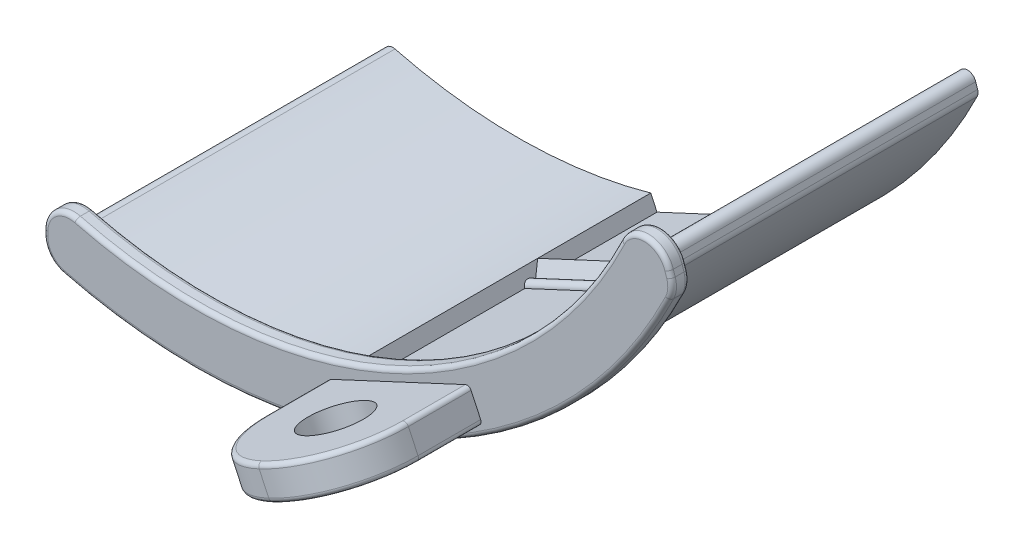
ISO-10303-21;
HEADER;
FILE_DESCRIPTION(('STEP AP214'),'2;1');
FILE_NAME('part.step','',(''),(''),'','','');
FILE_SCHEMA(('AUTOMOTIVE_DESIGN { 1 0 10303 214 1 1 1 1 }'));
ENDSEC;
DATA;
#1=APPLICATION_CONTEXT('core data for automotive mechanical design processes');
#2=APPLICATION_PROTOCOL_DEFINITION('international standard','automotive_design',2000,#1);
#3=PRODUCT_CONTEXT('',#1,'mechanical');
#4=PRODUCT('Part','Part','',(#3));
#5=PRODUCT_RELATED_PRODUCT_CATEGORY('part','',(#4));
#6=PRODUCT_DEFINITION_FORMATION('','',#4);
#7=PRODUCT_DEFINITION_CONTEXT('part definition',#1,'design');
#8=PRODUCT_DEFINITION('design','',#6,#7);
#9=PRODUCT_DEFINITION_SHAPE('','',#8);
#10=(LENGTH_UNIT() NAMED_UNIT(*) SI_UNIT(.MILLI.,.METRE.));
#11=(NAMED_UNIT(*) PLANE_ANGLE_UNIT() SI_UNIT($,.RADIAN.));
#12=(NAMED_UNIT(*) SI_UNIT($,.STERADIAN.) SOLID_ANGLE_UNIT());
#13=UNCERTAINTY_MEASURE_WITH_UNIT(LENGTH_MEASURE(1.E-05),#10,'distance_accuracy_value','');
#14=(GEOMETRIC_REPRESENTATION_CONTEXT(3) GLOBAL_UNCERTAINTY_ASSIGNED_CONTEXT((#13)) GLOBAL_UNIT_ASSIGNED_CONTEXT((#10,
#11,#12)) REPRESENTATION_CONTEXT('',''));
#15=CARTESIAN_POINT('',(0.,0.,0.));
#16=DIRECTION('',(0.,0.,1.));
#17=DIRECTION('',(1.,0.,0.));
#18=AXIS2_PLACEMENT_3D('',#15,#16,#17);
#19=CARTESIAN_POINT('',(32.4044960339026,-48.2256014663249,19.3347031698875));
#20=DIRECTION('',(0.422419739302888,-0.906400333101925,0.));
#21=DIRECTION('',(0.906400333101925,0.422419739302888,0.));
#22=AXIS2_PLACEMENT_3D('',#19,#20,#21);
#23=PLANE('',#22);
#24=DIRECTION('',(0.,0.,-1.));
#25=VECTOR('',#24,1.);
#26=CARTESIAN_POINT('',(32.4044960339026,-48.2256014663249,19.3347031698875));
#27=LINE('',#26,#25);
#28=CARTESIAN_POINT('',(32.4044960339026,-48.2256014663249,0.));
#29=VERTEX_POINT('',#28);
#30=CARTESIAN_POINT('',(32.4044960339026,-48.2256014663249,-19.96));
#31=VERTEX_POINT('',#30);
#32=EDGE_CURVE('E347',#29,#31,#27,.T.);
#33=ORIENTED_EDGE('',*,*,#32,.T.);
#34=DIRECTION('',(0.906400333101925,0.422419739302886,0.));
#35=VECTOR('',#34,1.);
#36=CARTESIAN_POINT('',(10.6521198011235,-58.3631011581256,-19.96));
#37=LINE('',#36,#35);
#38=CARTESIAN_POINT('',(16.089290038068,-55.8291567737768,-19.96));
#39=VERTEX_POINT('',#38);
#40=EDGE_CURVE('E323',#39,#31,#37,.T.);
#41=ORIENTED_EDGE('',*,*,#40,.F.);
#42=DIRECTION('',(0.,0.,-1.));
#43=VECTOR('',#42,1.);
#44=CARTESIAN_POINT('',(16.089290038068,-55.8291567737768,19.3347031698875));
#45=LINE('',#44,#43);
#46=CARTESIAN_POINT('',(16.089290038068,-55.8291567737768,0.));
#47=VERTEX_POINT('',#46);
#48=EDGE_CURVE('E356',#47,#39,#45,.T.);
#49=ORIENTED_EDGE('',*,*,#48,.F.);
#50=DIRECTION('',(-0.906400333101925,-0.422419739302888,0.));
#51=VECTOR('',#50,1.);
#52=CARTESIAN_POINT('',(32.4044960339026,-48.2256014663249,0.));
#53=LINE('',#52,#51);
#54=EDGE_CURVE('E342',#29,#47,#53,.T.);
#55=ORIENTED_EDGE('',*,*,#54,.F.);
#56=EDGE_LOOP('',(#33,#41,#49,#55));
#57=FACE_BOUND('',#56,.T.);
#58=ADVANCED_FACE('F32',(#57),#23,.F.);
#59=CARTESIAN_POINT('',(16.089290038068,-55.8291567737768,19.3347031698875));
#60=DIRECTION('',(-0.906400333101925,-0.422419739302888,0.));
#61=DIRECTION('',(0.422419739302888,-0.906400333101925,0.));
#62=AXIS2_PLACEMENT_3D('',#59,#60,#61);
#63=PLANE('',#62);
#64=DIRECTION('',(0.,0.,-1.));
#65=VECTOR('',#64,1.);
#66=CARTESIAN_POINT('',(15.3701389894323,-54.2860500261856,19.3347031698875));
#67=LINE('',#66,#65);
#68=CARTESIAN_POINT('',(15.3701389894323,-54.2860500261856,-22.1600000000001));
#69=VERTEX_POINT('',#68);
#70=CARTESIAN_POINT('',(15.3701389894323,-54.2860500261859,-35.16));
#71=VERTEX_POINT('',#70);
#72=EDGE_CURVE('E355',#69,#71,#67,.T.);
#73=ORIENTED_EDGE('',*,*,#72,.F.);
#74=DIRECTION('',(-0.184772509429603,0.396472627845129,0.899260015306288));
#75=VECTOR('',#74,1.);
#76=CARTESIAN_POINT('',(16.089290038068,-55.8291567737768,-25.66));
#77=LINE('',#76,#75);
#78=CARTESIAN_POINT('',(16.089290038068,-55.8291567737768,-25.66));
#79=VERTEX_POINT('',#78);
#80=EDGE_CURVE('E54',#79,#69,#77,.T.);
#81=ORIENTED_EDGE('',*,*,#80,.F.);
#82=CARTESIAN_POINT('',(16.089290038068,-55.8291567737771,-35.16));
#83=VERTEX_POINT('',#82);
#84=EDGE_CURVE('E350',#79,#83,#45,.T.);
#85=ORIENTED_EDGE('',*,*,#84,.T.);
#86=DIRECTION('',(-0.422419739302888,0.906400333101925,0.));
#87=VECTOR('',#86,1.);
#88=CARTESIAN_POINT('',(16.089290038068,-55.8291567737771,-35.16));
#89=LINE('',#88,#87);
#90=EDGE_CURVE('E339',#83,#71,#89,.T.);
#91=ORIENTED_EDGE('',*,*,#90,.T.);
#92=EDGE_LOOP('',(#73,#81,#85,#91));
#93=FACE_BOUND('',#92,.T.);
#94=ADVANCED_FACE('F715',(#93),#63,.F.);
#95=CARTESIAN_POINT('',(32.4044960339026,-48.2256014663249,19.3347031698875));
#96=DIRECTION('',(-0.906400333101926,-0.422419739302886,0.));
#97=DIRECTION('',(0.422419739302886,-0.906400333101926,0.));
#98=AXIS2_PLACEMENT_3D('',#95,#96,#97);
#99=PLANE('',#98);
#100=DIRECTION('',(-0.184772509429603,0.396472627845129,0.899260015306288));
#101=VECTOR('',#100,1.);
#102=CARTESIAN_POINT('',(32.4044960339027,-48.2256014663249,-25.66));
#103=LINE('',#102,#101);
#104=CARTESIAN_POINT('',(32.4044960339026,-48.2256014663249,-25.6599999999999));
#105=VERTEX_POINT('',#104);
#106=CARTESIAN_POINT('',(31.685344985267,-46.6824947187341,-22.1600000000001));
#107=VERTEX_POINT('',#106);
#108=EDGE_CURVE('E312',#105,#107,#103,.T.);
#109=ORIENTED_EDGE('',*,*,#108,.T.);
#110=DIRECTION('',(0.,0.,-1.));
#111=VECTOR('',#110,1.);
#112=CARTESIAN_POINT('',(31.6853449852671,-46.6824947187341,19.3347031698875));
#113=LINE('',#112,#111);
#114=CARTESIAN_POINT('',(31.685344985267,-46.6824947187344,-35.16));
#115=VERTEX_POINT('',#114);
#116=EDGE_CURVE('E359',#107,#115,#113,.T.);
#117=ORIENTED_EDGE('',*,*,#116,.T.);
#118=DIRECTION('',(-0.422419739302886,0.906400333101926,0.));
#119=VECTOR('',#118,1.);
#120=CARTESIAN_POINT('',(32.4044960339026,-48.2256014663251,-35.16));
#121=LINE('',#120,#119);
#122=CARTESIAN_POINT('',(32.4044960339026,-48.2256014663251,-35.16));
#123=VERTEX_POINT('',#122);
#124=EDGE_CURVE('E343',#123,#115,#121,.T.);
#125=ORIENTED_EDGE('',*,*,#124,.F.);
#126=EDGE_CURVE('E358',#105,#123,#27,.T.);
#127=ORIENTED_EDGE('',*,*,#126,.F.);
#128=EDGE_LOOP('',(#109,#117,#125,#127));
#129=FACE_BOUND('',#128,.T.);
#130=ADVANCED_FACE('F722',(#129),#99,.T.);
#131=CARTESIAN_POINT('',(0.,0.,-35.16));
#132=DIRECTION('',(0.,0.,1.));
#133=DIRECTION('',(1.,0.,0.));
#134=AXIS2_PLACEMENT_3D('',#131,#132,#133);
#135=CYLINDRICAL_SURFACE('',#134,56.4200000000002);
#136=CARTESIAN_POINT('',(31.6853449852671,-46.6824947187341,0.));
#137=VERTEX_POINT('',#136);
#138=EDGE_CURVE('E308',#137,#107,#113,.T.);
#139=ORIENTED_EDGE('',*,*,#138,.F.);
#140=CARTESIAN_POINT('',(0.,0.,0.));
#141=DIRECTION('',(0.,0.,1.));
#142=DIRECTION('',(1.,0.,0.));
#143=AXIS2_PLACEMENT_3D('',#140,#141,#142);
#144=CIRCLE('',#143,56.4200000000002);
#145=CARTESIAN_POINT('',(50.8708063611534,-24.400357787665,0.));
#146=VERTEX_POINT('',#145);
#147=EDGE_CURVE('E538',#137,#146,#144,.T.);
#148=ORIENTED_EDGE('',*,*,#147,.T.);
#149=DIRECTION('',(0.,0.,1.));
#150=VECTOR('',#149,1.);
#151=CARTESIAN_POINT('',(50.8708063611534,-24.400357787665,-35.16));
#152=LINE('',#151,#150);
#153=CARTESIAN_POINT('',(50.8708063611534,-24.400357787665,-35.16));
#154=VERTEX_POINT('',#153);
#155=EDGE_CURVE('E490',#154,#146,#152,.T.);
#156=ORIENTED_EDGE('',*,*,#155,.F.);
#157=CARTESIAN_POINT('',(0.,0.,-35.16));
#158=DIRECTION('',(0.,0.,1.));
#159=DIRECTION('',(1.,0.,0.));
#160=AXIS2_PLACEMENT_3D('',#157,#158,#159);
#161=CIRCLE('',#160,56.4200000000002);
#162=EDGE_CURVE('E469',#115,#154,#161,.T.);
#163=ORIENTED_EDGE('',*,*,#162,.F.);
#164=ORIENTED_EDGE('',*,*,#116,.F.);
#165=EDGE_LOOP('',(#139,#148,#156,#163,#164));
#166=FACE_BOUND('',#165,.T.);
#167=ADVANCED_FACE('F744',(#166),#135,.F.);
#168=CARTESIAN_POINT('',(-14.28,-56.1114212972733,2.));
#169=DIRECTION('',(0.,0.,1.));
#170=DIRECTION('',(1.,0.,0.));
#171=AXIS2_PLACEMENT_3D('',#168,#169,#170);
#172=PLANE('',#171);
#173=CARTESIAN_POINT('',(51.7724512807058,-24.83283488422,2.));
#174=DIRECTION('',(0.,0.,1.));
#175=DIRECTION('',(1.,0.,0.));
#176=AXIS2_PLACEMENT_3D('',#173,#174,#175);
#177=CIRCLE('',#176,2.49999999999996);
#178=CARTESIAN_POINT('',(54.1524701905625,-24.0676486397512,2.));
#179=VERTEX_POINT('',#178);
#180=CARTESIAN_POINT('',(49.5183389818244,-23.7516421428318,2.));
#181=VERTEX_POINT('',#180);
#182=EDGE_CURVE('E567',#179,#181,#177,.T.);
#183=ORIENTED_EDGE('',*,*,#182,.T.);
#184=CARTESIAN_POINT('',(0.,0.,2.));
#185=DIRECTION('',(0.,0.,1.));
#186=DIRECTION('',(1.,0.,0.));
#187=AXIS2_PLACEMENT_3D('',#184,#185,#186);
#188=CIRCLE('',#187,54.9200000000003);
#189=CARTESIAN_POINT('',(-13.658265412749,-53.194531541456,2.));
#190=VERTEX_POINT('',#189);
#191=EDGE_CURVE('E571',#181,#190,#188,.F.);
#192=ORIENTED_EDGE('',*,*,#191,.T.);
#193=CARTESIAN_POINT('',(-14.28,-55.6159869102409,2.));
#194=DIRECTION('',(0.,0.,1.));
#195=DIRECTION('',(1.,0.,0.));
#196=AXIS2_PLACEMENT_3D('',#193,#194,#195);
#197=CIRCLE('',#196,2.50000000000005);
#198=CARTESIAN_POINT('',(-16.7800000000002,-55.6159869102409,2.));
#199=VERTEX_POINT('',#198);
#200=EDGE_CURVE('E569',#190,#199,#197,.T.);
#201=ORIENTED_EDGE('',*,*,#200,.T.);
#202=DIRECTION('',(7.77315264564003E-13,-0.999999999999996,0.));
#203=VECTOR('',#202,1.);
#204=CARTESIAN_POINT('',(-16.7799999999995,-56.1114212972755,2.));
#205=LINE('',#204,#203);
#206=CARTESIAN_POINT('',(-16.7799999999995,-56.1114212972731,2.));
#207=VERTEX_POINT('',#206);
#208=EDGE_CURVE('E565',#199,#207,#205,.T.);
#209=ORIENTED_EDGE('',*,*,#208,.T.);
#210=CARTESIAN_POINT('',(-14.28,-56.1114212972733,2.));
#211=DIRECTION('',(0.,0.,1.));
#212=DIRECTION('',(1.,0.,0.));
#213=AXIS2_PLACEMENT_3D('',#210,#211,#212);
#214=CIRCLE('',#213,2.49999999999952);
#215=CARTESIAN_POINT('',(-14.8965803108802,-58.5341942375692,2.));
#216=VERTEX_POINT('',#215);
#217=EDGE_CURVE('E561',#207,#216,#214,.T.);
#218=ORIENTED_EDGE('',*,*,#217,.T.);
#219=CARTESIAN_POINT('',(0.,0.,2.));
#220=DIRECTION('',(0.,0.,1.));
#221=DIRECTION('',(1.,0.,0.));
#222=AXIS2_PLACEMENT_3D('',#219,#220,#221);
#223=CIRCLE('',#222,60.4000000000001);
#224=CARTESIAN_POINT('',(54.2297168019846,-26.5950712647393,2.));
#225=VERTEX_POINT('',#224);
#226=EDGE_CURVE('E557',#216,#225,#223,.T.);
#227=ORIENTED_EDGE('',*,*,#226,.T.);
#228=CARTESIAN_POINT('',(51.9851093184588,-25.4942818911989,2.));
#229=DIRECTION('',(0.,0.,1.));
#230=DIRECTION('',(1.,0.,0.));
#231=AXIS2_PLACEMENT_3D('',#228,#229,#230);
#232=CIRCLE('',#231,2.49999999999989);
#233=CARTESIAN_POINT('',(54.3651282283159,-24.7290956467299,2.));
#234=VERTEX_POINT('',#233);
#235=EDGE_CURVE('E559',#225,#234,#232,.T.);
#236=ORIENTED_EDGE('',*,*,#235,.T.);
#237=DIRECTION('',(-0.306074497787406,0.952007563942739,0.));
#238=VECTOR('',#237,1.);
#239=CARTESIAN_POINT('',(57.0786893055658,-33.1692979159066,2.));
#240=LINE('',#239,#238);
#241=EDGE_CURVE('E563',#234,#179,#240,.T.);
#242=ORIENTED_EDGE('',*,*,#241,.T.);
#243=EDGE_LOOP('',(#183,#192,#201,#209,#218,#227,#236,#242));
#244=FACE_BOUND('',#243,.T.);
#245=DIRECTION('',(-0.906400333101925,-0.422419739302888,0.));
#246=VECTOR('',#245,1.);
#247=CARTESIAN_POINT('',(33.1879114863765,-49.9066025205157,2.));
#248=LINE('',#247,#246);
#249=CARTESIAN_POINT('',(32.7347113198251,-50.1178123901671,2.));
#250=VERTEX_POINT('',#249);
#251=CARTESIAN_POINT('',(17.3259056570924,-57.2989479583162,2.));
#252=VERTEX_POINT('',#251);
#253=EDGE_CURVE('E442',#250,#252,#248,.T.);
#254=ORIENTED_EDGE('',*,*,#253,.T.);
#255=CARTESIAN_POINT('',(17.1146957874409,-56.8457477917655,2.));
#256=DIRECTION('',(0.,0.,1.));
#257=DIRECTION('',(1.,0.,0.));
#258=AXIS2_PLACEMENT_3D('',#255,#256,#257);
#259=CIRCLE('',#258,0.5);
#260=CARTESIAN_POINT('',(16.6614956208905,-57.0569576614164,2.));
#261=VERTEX_POINT('',#260);
#262=EDGE_CURVE('E40',#252,#261,#259,.F.);
#263=ORIENTED_EDGE('',*,*,#262,.T.);
#264=DIRECTION('',(-0.422419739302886,0.906400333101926,0.));
#265=VECTOR('',#264,1.);
#266=CARTESIAN_POINT('',(16.8727054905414,-57.5101578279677,2.));
#267=LINE('',#266,#265);
#268=CARTESIAN_POINT('',(15.5632042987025,-54.7003167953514,2.));
#269=VERTEX_POINT('',#268);
#270=EDGE_CURVE('E445',#261,#269,#267,.T.);
#271=ORIENTED_EDGE('',*,*,#270,.T.);
#272=CARTESIAN_POINT('',(16.0164044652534,-54.4891069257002,2.));
#273=DIRECTION('',(0.,0.,1.));
#274=DIRECTION('',(1.,0.,0.));
#275=AXIS2_PLACEMENT_3D('',#272,#273,#274);
#276=CIRCLE('',#275,0.5);
#277=CARTESIAN_POINT('',(15.805194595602,-54.0359067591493,2.));
#278=VERTEX_POINT('',#277);
#279=EDGE_CURVE('E11',#269,#278,#276,.F.);
#280=ORIENTED_EDGE('',*,*,#279,.T.);
#281=DIRECTION('',(0.906400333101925,0.422419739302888,0.));
#282=VECTOR('',#281,1.);
#283=CARTESIAN_POINT('',(15.351994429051,-54.2471166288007,2.));
#284=LINE('',#283,#282);
#285=CARTESIAN_POINT('',(31.2140002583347,-46.8547711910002,2.));
#286=VERTEX_POINT('',#285);
#287=EDGE_CURVE('E436',#278,#286,#284,.T.);
#288=ORIENTED_EDGE('',*,*,#287,.T.);
#289=CARTESIAN_POINT('',(31.4252101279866,-47.3079713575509,2.));
#290=DIRECTION('',(0.,0.,1.));
#291=DIRECTION('',(1.,0.,0.));
#292=AXIS2_PLACEMENT_3D('',#289,#290,#291);
#293=CIRCLE('',#292,0.5);
#294=CARTESIAN_POINT('',(31.8784102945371,-47.0967614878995,2.));
#295=VERTEX_POINT('',#294);
#296=EDGE_CURVE('E655',#286,#295,#293,.F.);
#297=ORIENTED_EDGE('',*,*,#296,.T.);
#298=DIRECTION('',(0.422419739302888,-0.906400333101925,0.));
#299=VECTOR('',#298,1.);
#300=CARTESIAN_POINT('',(31.6672004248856,-46.6435613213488,2.));
#301=LINE('',#300,#299);
#302=CARTESIAN_POINT('',(32.9767016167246,-49.4534023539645,2.));
#303=VERTEX_POINT('',#302);
#304=EDGE_CURVE('E439',#295,#303,#301,.T.);
#305=ORIENTED_EDGE('',*,*,#304,.T.);
#306=CARTESIAN_POINT('',(32.5235014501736,-49.6646122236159,2.));
#307=DIRECTION('',(0.,0.,1.));
#308=DIRECTION('',(1.,0.,0.));
#309=AXIS2_PLACEMENT_3D('',#306,#307,#308);
#310=CIRCLE('',#309,0.5);
#311=EDGE_CURVE('E653',#303,#250,#310,.F.);
#312=ORIENTED_EDGE('',*,*,#311,.T.);
#313=EDGE_LOOP('',(#254,#263,#271,#280,#288,#297,#305,#312));
#314=FACE_BOUND('',#313,.T.);
#315=ADVANCED_FACE('F659',(#244,#314),#172,.T.);
#316=CARTESIAN_POINT('',(-14.28,-56.1114212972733,2.));
#317=DIRECTION('',(0.,0.,-1.));
#318=DIRECTION('',(-1.,0.,0.));
#319=AXIS2_PLACEMENT_3D('',#316,#317,#318);
#320=CYLINDRICAL_SURFACE('',#319,2.99999999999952);
#321=DIRECTION('',(0.,0.,-1.));
#322=VECTOR('',#321,1.);
#323=CARTESIAN_POINT('',(-15.019896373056,-59.0187488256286,2.));
#324=LINE('',#323,#322);
#325=CARTESIAN_POINT('',(-15.019896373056,-59.0187488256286,1.49999999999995));
#326=VERTEX_POINT('',#325);
#327=CARTESIAN_POINT('',(-15.019896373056,-59.0187488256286,0.499999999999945));
#328=VERTEX_POINT('',#327);
#329=EDGE_CURVE('E517',#326,#328,#324,.T.);
#330=ORIENTED_EDGE('',*,*,#329,.F.);
#331=CARTESIAN_POINT('',(-14.28,-56.1114212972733,1.49999999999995));
#332=DIRECTION('',(0.,0.,1.));
#333=DIRECTION('',(1.,0.,0.));
#334=AXIS2_PLACEMENT_3D('',#331,#332,#333);
#335=CIRCLE('',#334,2.99999999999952);
#336=CARTESIAN_POINT('',(-17.2799999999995,-56.1114212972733,1.49999999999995));
#337=VERTEX_POINT('',#336);
#338=EDGE_CURVE('E635',#326,#337,#335,.F.);
#339=ORIENTED_EDGE('',*,*,#338,.T.);
#340=DIRECTION('',(0.,0.,-1.));
#341=VECTOR('',#340,1.);
#342=CARTESIAN_POINT('',(-17.2799999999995,-56.1114212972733,2.));
#343=LINE('',#342,#341);
#344=CARTESIAN_POINT('',(-17.2799999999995,-56.1114212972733,0.499999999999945));
#345=VERTEX_POINT('',#344);
#346=EDGE_CURVE('E496',#337,#345,#343,.T.);
#347=ORIENTED_EDGE('',*,*,#346,.T.);
#348=CARTESIAN_POINT('',(-14.28,-56.1114212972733,0.499999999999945));
#349=DIRECTION('',(0.,0.,1.));
#350=DIRECTION('',(1.,0.,0.));
#351=AXIS2_PLACEMENT_3D('',#348,#349,#350);
#352=CIRCLE('',#351,2.99999999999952);
#353=EDGE_CURVE('E633',#345,#328,#352,.T.);
#354=ORIENTED_EDGE('',*,*,#353,.T.);
#355=EDGE_LOOP('',(#330,#339,#347,#354));
#356=FACE_BOUND('',#355,.T.);
#357=ADVANCED_FACE('F806',(#356),#320,.T.);
#358=CARTESIAN_POINT('',(0.,0.,2.));
#359=DIRECTION('',(0.,0.,-1.));
#360=DIRECTION('',(-1.,0.,0.));
#361=AXIS2_PLACEMENT_3D('',#358,#359,#360);
#362=CYLINDRICAL_SURFACE('',#361,60.9000000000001);
#363=DIRECTION('',(0.,0.,-1.));
#364=VECTOR('',#363,1.);
#365=CARTESIAN_POINT('',(54.6786382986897,-26.8152291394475,2.));
#366=LINE('',#365,#364);
#367=CARTESIAN_POINT('',(54.6786382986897,-26.8152291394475,1.49999999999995));
#368=VERTEX_POINT('',#367);
#369=CARTESIAN_POINT('',(54.6786382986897,-26.8152291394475,0.499999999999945));
#370=VERTEX_POINT('',#369);
#371=EDGE_CURVE('E514',#368,#370,#366,.T.);
#372=ORIENTED_EDGE('',*,*,#371,.F.);
#373=CARTESIAN_POINT('',(0.,0.,1.49999999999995));
#374=DIRECTION('',(0.,0.,1.));
#375=DIRECTION('',(1.,0.,0.));
#376=AXIS2_PLACEMENT_3D('',#373,#374,#375);
#377=CIRCLE('',#376,60.9000000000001);
#378=EDGE_CURVE('E647',#368,#326,#377,.F.);
#379=ORIENTED_EDGE('',*,*,#378,.T.);
#380=ORIENTED_EDGE('',*,*,#329,.T.);
#381=CARTESIAN_POINT('',(0.,0.,0.499999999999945));
#382=DIRECTION('',(0.,0.,1.));
#383=DIRECTION('',(1.,0.,0.));
#384=AXIS2_PLACEMENT_3D('',#381,#382,#383);
#385=CIRCLE('',#384,60.9000000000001);
#386=EDGE_CURVE('E645',#328,#370,#385,.T.);
#387=ORIENTED_EDGE('',*,*,#386,.T.);
#388=EDGE_LOOP('',(#372,#379,#380,#387));
#389=FACE_BOUND('',#388,.T.);
#390=ADVANCED_FACE('F34',(#389),#362,.T.);
#391=CARTESIAN_POINT('',(51.9851093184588,-25.4942818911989,2.));
#392=DIRECTION('',(0.,0.,-1.));
#393=DIRECTION('',(-1.,0.,0.));
#394=AXIS2_PLACEMENT_3D('',#391,#392,#393);
#395=CYLINDRICAL_SURFACE('',#394,2.99999999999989);
#396=DIRECTION('',(0.,0.,-1.));
#397=VECTOR('',#396,1.);
#398=CARTESIAN_POINT('',(54.8411320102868,-24.5760583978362,2.));
#399=LINE('',#398,#397);
#400=CARTESIAN_POINT('',(54.8411320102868,-24.5760583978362,1.49999999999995));
#401=VERTEX_POINT('',#400);
#402=CARTESIAN_POINT('',(54.8411320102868,-24.5760583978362,0.499999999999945));
#403=VERTEX_POINT('',#402);
#404=EDGE_CURVE('E511',#401,#403,#399,.T.);
#405=ORIENTED_EDGE('',*,*,#404,.F.);
#406=CARTESIAN_POINT('',(51.9851093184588,-25.4942818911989,1.49999999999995));
#407=DIRECTION('',(0.,0.,1.));
#408=DIRECTION('',(1.,0.,0.));
#409=AXIS2_PLACEMENT_3D('',#406,#407,#408);
#410=CIRCLE('',#409,2.99999999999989);
#411=EDGE_CURVE('E639',#401,#368,#410,.F.);
#412=ORIENTED_EDGE('',*,*,#411,.T.);
#413=ORIENTED_EDGE('',*,*,#371,.T.);
#414=CARTESIAN_POINT('',(51.9851093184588,-25.4942818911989,0.499999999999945));
#415=DIRECTION('',(0.,0.,1.));
#416=DIRECTION('',(1.,0.,0.));
#417=AXIS2_PLACEMENT_3D('',#414,#415,#416);
#418=CIRCLE('',#417,2.99999999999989);
#419=EDGE_CURVE('E637',#370,#403,#418,.T.);
#420=ORIENTED_EDGE('',*,*,#419,.T.);
#421=EDGE_LOOP('',(#405,#412,#413,#420));
#422=FACE_BOUND('',#421,.T.);
#423=ADVANCED_FACE('F828',(#422),#395,.T.);
#424=CARTESIAN_POINT('',(54.8411320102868,-24.5760583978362,2.));
#425=DIRECTION('',(-0.952007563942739,-0.306074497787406,0.));
#426=DIRECTION('',(0.306074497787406,-0.952007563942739,0.));
#427=AXIS2_PLACEMENT_3D('',#424,#425,#426);
#428=PLANE('',#427);
#429=DIRECTION('',(0.,0.,-1.));
#430=VECTOR('',#429,1.);
#431=CARTESIAN_POINT('',(54.6284739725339,-23.9146113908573,2.));
#432=LINE('',#431,#430);
#433=CARTESIAN_POINT('',(54.6284739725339,-23.9146113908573,1.49999999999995));
#434=VERTEX_POINT('',#433);
#435=CARTESIAN_POINT('',(54.6284739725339,-23.9146113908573,0.499999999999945));
#436=VERTEX_POINT('',#435);
#437=EDGE_CURVE('E508',#434,#436,#432,.T.);
#438=ORIENTED_EDGE('',*,*,#437,.F.);
#439=DIRECTION('',(-0.306074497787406,0.952007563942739,0.));
#440=VECTOR('',#439,1.);
#441=CARTESIAN_POINT('',(57.5546930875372,-33.0162606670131,1.49999999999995));
#442=LINE('',#441,#440);
#443=EDGE_CURVE('E627',#434,#401,#442,.F.);
#444=ORIENTED_EDGE('',*,*,#443,.T.);
#445=ORIENTED_EDGE('',*,*,#404,.T.);
#446=DIRECTION('',(-0.306074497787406,0.952007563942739,0.));
#447=VECTOR('',#446,1.);
#448=CARTESIAN_POINT('',(54.8411320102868,-24.5760583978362,0.499999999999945));
#449=LINE('',#448,#447);
#450=EDGE_CURVE('E625',#403,#436,#449,.T.);
#451=ORIENTED_EDGE('',*,*,#450,.T.);
#452=EDGE_LOOP('',(#438,#444,#445,#451));
#453=FACE_BOUND('',#452,.T.);
#454=ADVANCED_FACE('F825',(#453),#428,.F.);
#455=CARTESIAN_POINT('',(51.7724512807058,-24.83283488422,2.));
#456=DIRECTION('',(0.,0.,-1.));
#457=DIRECTION('',(-1.,0.,0.));
#458=AXIS2_PLACEMENT_3D('',#455,#456,#457);
#459=CYLINDRICAL_SURFACE('',#458,2.99999999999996);
#460=DIRECTION('',(0.,0.,-1.));
#461=VECTOR('',#460,1.);
#462=CARTESIAN_POINT('',(49.0675165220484,-23.535403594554,2.));
#463=LINE('',#462,#461);
#464=CARTESIAN_POINT('',(49.0675165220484,-23.535403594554,1.49999999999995));
#465=VERTEX_POINT('',#464);
#466=CARTESIAN_POINT('',(49.0675165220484,-23.535403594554,0.499999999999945));
#467=VERTEX_POINT('',#466);
#468=EDGE_CURVE('E505',#465,#467,#463,.T.);
#469=ORIENTED_EDGE('',*,*,#468,.F.);
#470=CARTESIAN_POINT('',(51.7724512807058,-24.83283488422,1.49999999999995));
#471=DIRECTION('',(0.,0.,1.));
#472=DIRECTION('',(1.,0.,0.));
#473=AXIS2_PLACEMENT_3D('',#470,#471,#472);
#474=CIRCLE('',#473,2.99999999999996);
#475=EDGE_CURVE('E597',#465,#434,#474,.F.);
#476=ORIENTED_EDGE('',*,*,#475,.T.);
#477=ORIENTED_EDGE('',*,*,#437,.T.);
#478=CARTESIAN_POINT('',(51.7724512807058,-24.83283488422,0.499999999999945));
#479=DIRECTION('',(0.,0.,1.));
#480=DIRECTION('',(1.,0.,0.));
#481=AXIS2_PLACEMENT_3D('',#478,#479,#480);
#482=CIRCLE('',#481,2.99999999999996);
#483=EDGE_CURVE('E595',#436,#467,#482,.T.);
#484=ORIENTED_EDGE('',*,*,#483,.T.);
#485=EDGE_LOOP('',(#469,#476,#477,#484));
#486=FACE_BOUND('',#485,.T.);
#487=ADVANCED_FACE('F821',(#486),#459,.T.);
#488=CARTESIAN_POINT('',(0.,0.,2.));
#489=DIRECTION('',(0.,0.,-1.));
#490=DIRECTION('',(-1.,0.,0.));
#491=AXIS2_PLACEMENT_3D('',#488,#489,#490);
#492=CYLINDRICAL_SURFACE('',#491,54.4200000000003);
#493=DIRECTION('',(0.,0.,-1.));
#494=VECTOR('',#493,1.);
#495=CARTESIAN_POINT('',(-13.5339184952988,-52.7102404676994,2.));
#496=LINE('',#495,#494);
#497=CARTESIAN_POINT('',(-13.5339184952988,-52.7102404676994,1.49999999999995));
#498=VERTEX_POINT('',#497);
#499=CARTESIAN_POINT('',(-13.5339184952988,-52.7102404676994,0.499999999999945));
#500=VERTEX_POINT('',#499);
#501=EDGE_CURVE('E502',#498,#500,#496,.T.);
#502=ORIENTED_EDGE('',*,*,#501,.F.);
#503=CARTESIAN_POINT('',(0.,0.,1.49999999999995));
#504=DIRECTION('',(0.,0.,1.));
#505=DIRECTION('',(1.,0.,0.));
#506=AXIS2_PLACEMENT_3D('',#503,#504,#505);
#507=CIRCLE('',#506,54.4200000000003);
#508=EDGE_CURVE('E554',#498,#465,#507,.T.);
#509=ORIENTED_EDGE('',*,*,#508,.T.);
#510=ORIENTED_EDGE('',*,*,#468,.T.);
#511=CARTESIAN_POINT('',(0.,0.,0.499999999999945));
#512=DIRECTION('',(0.,0.,1.));
#513=DIRECTION('',(1.,0.,0.));
#514=AXIS2_PLACEMENT_3D('',#511,#512,#513);
#515=CIRCLE('',#514,54.4200000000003);
#516=EDGE_CURVE('E551',#467,#500,#515,.F.);
#517=ORIENTED_EDGE('',*,*,#516,.T.);
#518=EDGE_LOOP('',(#502,#509,#510,#517));
#519=FACE_BOUND('',#518,.T.);
#520=ADVANCED_FACE('F817',(#519),#492,.F.);
#521=CARTESIAN_POINT('',(-14.28,-55.6159869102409,2.));
#522=DIRECTION('',(0.,0.,-1.));
#523=DIRECTION('',(-1.,0.,0.));
#524=AXIS2_PLACEMENT_3D('',#521,#522,#523);
#525=CYLINDRICAL_SURFACE('',#524,3.00000000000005);
#526=DIRECTION('',(0.,0.,-1.));
#527=VECTOR('',#526,1.);
#528=CARTESIAN_POINT('',(-17.2799999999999,-55.6159869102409,2.));
#529=LINE('',#528,#527);
#530=CARTESIAN_POINT('',(-17.2799999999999,-55.6159869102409,1.49999999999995));
#531=VERTEX_POINT('',#530);
#532=CARTESIAN_POINT('',(-17.2799999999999,-55.6159869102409,0.499999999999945));
#533=VERTEX_POINT('',#532);
#534=EDGE_CURVE('E499',#531,#533,#529,.T.);
#535=ORIENTED_EDGE('',*,*,#534,.F.);
#536=CARTESIAN_POINT('',(-14.28,-55.6159869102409,1.49999999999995));
#537=DIRECTION('',(0.,0.,1.));
#538=DIRECTION('',(1.,0.,0.));
#539=AXIS2_PLACEMENT_3D('',#536,#537,#538);
#540=CIRCLE('',#539,3.00000000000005);
#541=EDGE_CURVE('E593',#531,#498,#540,.F.);
#542=ORIENTED_EDGE('',*,*,#541,.T.);
#543=ORIENTED_EDGE('',*,*,#501,.T.);
#544=CARTESIAN_POINT('',(-14.28,-55.6159869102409,0.499999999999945));
#545=DIRECTION('',(0.,0.,1.));
#546=DIRECTION('',(1.,0.,0.));
#547=AXIS2_PLACEMENT_3D('',#544,#545,#546);
#548=CIRCLE('',#547,3.00000000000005);
#549=EDGE_CURVE('E591',#500,#533,#548,.T.);
#550=ORIENTED_EDGE('',*,*,#549,.T.);
#551=EDGE_LOOP('',(#535,#542,#543,#550));
#552=FACE_BOUND('',#551,.T.);
#553=ADVANCED_FACE('F813',(#552),#525,.T.);
#554=CARTESIAN_POINT('',(-17.2799999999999,-55.6159869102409,2.));
#555=DIRECTION('',(0.999999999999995,7.7731527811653E-13,0.));
#556=DIRECTION('',(-7.7731527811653E-13,0.999999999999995,0.));
#557=AXIS2_PLACEMENT_3D('',#554,#555,#556);
#558=PLANE('',#557);
#559=ORIENTED_EDGE('',*,*,#346,.F.);
#560=DIRECTION('',(7.77315264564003E-13,-0.999999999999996,0.));
#561=VECTOR('',#560,1.);
#562=CARTESIAN_POINT('',(-17.2799999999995,-56.1114212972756,1.49999999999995));
#563=LINE('',#562,#561);
#564=EDGE_CURVE('E623',#337,#531,#563,.F.);
#565=ORIENTED_EDGE('',*,*,#564,.T.);
#566=ORIENTED_EDGE('',*,*,#534,.T.);
#567=DIRECTION('',(7.77315264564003E-13,-0.999999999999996,0.));
#568=VECTOR('',#567,1.);
#569=CARTESIAN_POINT('',(-17.2799999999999,-55.6159869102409,0.499999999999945));
#570=LINE('',#569,#568);
#571=EDGE_CURVE('E621',#533,#345,#570,.T.);
#572=ORIENTED_EDGE('',*,*,#571,.T.);
#573=EDGE_LOOP('',(#559,#565,#566,#572));
#574=FACE_BOUND('',#573,.T.);
#575=ADVANCED_FACE('F786',(#574),#558,.F.);
#576=CARTESIAN_POINT('',(-14.28,-56.1114212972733,0.));
#577=DIRECTION('',(0.,0.,1.));
#578=DIRECTION('',(1.,0.,0.));
#579=AXIS2_PLACEMENT_3D('',#576,#577,#578);
#580=PLANE('',#579);
#581=CARTESIAN_POINT('',(-14.28,-55.6159869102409,0.));
#582=DIRECTION('',(0.,0.,1.));
#583=DIRECTION('',(1.,0.,0.));
#584=AXIS2_PLACEMENT_3D('',#581,#582,#583);
#585=CIRCLE('',#584,2.50000000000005);
#586=CARTESIAN_POINT('',(-16.7800000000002,-55.6159869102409,0.));
#587=VERTEX_POINT('',#586);
#588=CARTESIAN_POINT('',(-13.658265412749,-53.194531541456,0.));
#589=VERTEX_POINT('',#588);
#590=EDGE_CURVE('E586',#587,#589,#585,.F.);
#591=ORIENTED_EDGE('',*,*,#590,.T.);
#592=CARTESIAN_POINT('',(0.,0.,0.));
#593=DIRECTION('',(0.,0.,1.));
#594=DIRECTION('',(1.,0.,0.));
#595=AXIS2_PLACEMENT_3D('',#592,#593,#594);
#596=CIRCLE('',#595,54.9200000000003);
#597=CARTESIAN_POINT('',(49.5183389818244,-23.7516421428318,0.));
#598=VERTEX_POINT('',#597);
#599=EDGE_CURVE('E588',#589,#598,#596,.T.);
#600=ORIENTED_EDGE('',*,*,#599,.T.);
#601=CARTESIAN_POINT('',(51.7724512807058,-24.83283488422,0.));
#602=DIRECTION('',(0.,0.,1.));
#603=DIRECTION('',(1.,0.,0.));
#604=AXIS2_PLACEMENT_3D('',#601,#602,#603);
#605=CIRCLE('',#604,2.49999999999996);
#606=CARTESIAN_POINT('',(54.1524701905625,-24.0676486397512,0.));
#607=VERTEX_POINT('',#606);
#608=EDGE_CURVE('E584',#598,#607,#605,.F.);
#609=ORIENTED_EDGE('',*,*,#608,.T.);
#610=DIRECTION('',(-0.306074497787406,0.952007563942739,0.));
#611=VECTOR('',#610,1.);
#612=CARTESIAN_POINT('',(57.0786893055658,-33.1692979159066,0.));
#613=LINE('',#612,#611);
#614=CARTESIAN_POINT('',(54.3651282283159,-24.7290956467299,0.));
#615=VERTEX_POINT('',#614);
#616=EDGE_CURVE('E580',#607,#615,#613,.F.);
#617=ORIENTED_EDGE('',*,*,#616,.T.);
#618=CARTESIAN_POINT('',(51.9851093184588,-25.4942818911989,0.));
#619=DIRECTION('',(0.,0.,1.));
#620=DIRECTION('',(1.,0.,0.));
#621=AXIS2_PLACEMENT_3D('',#618,#619,#620);
#622=CIRCLE('',#621,2.49999999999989);
#623=CARTESIAN_POINT('',(54.2297168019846,-26.5950712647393,0.));
#624=VERTEX_POINT('',#623);
#625=EDGE_CURVE('E576',#615,#624,#622,.F.);
#626=ORIENTED_EDGE('',*,*,#625,.T.);
#627=CARTESIAN_POINT('',(0.,0.,0.));
#628=DIRECTION('',(0.,0.,1.));
#629=DIRECTION('',(1.,0.,0.));
#630=AXIS2_PLACEMENT_3D('',#627,#628,#629);
#631=CIRCLE('',#630,60.4000000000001);
#632=CARTESIAN_POINT('',(-14.8965803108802,-58.5341942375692,0.));
#633=VERTEX_POINT('',#632);
#634=EDGE_CURVE('E574',#624,#633,#631,.F.);
#635=ORIENTED_EDGE('',*,*,#634,.T.);
#636=CARTESIAN_POINT('',(-14.28,-56.1114212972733,0.));
#637=DIRECTION('',(0.,0.,1.));
#638=DIRECTION('',(1.,0.,0.));
#639=AXIS2_PLACEMENT_3D('',#636,#637,#638);
#640=CIRCLE('',#639,2.49999999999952);
#641=CARTESIAN_POINT('',(-16.7799999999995,-56.1114212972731,0.));
#642=VERTEX_POINT('',#641);
#643=EDGE_CURVE('E578',#633,#642,#640,.F.);
#644=ORIENTED_EDGE('',*,*,#643,.T.);
#645=DIRECTION('',(7.77315264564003E-13,-0.999999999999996,0.));
#646=VECTOR('',#645,1.);
#647=CARTESIAN_POINT('',(-16.7799999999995,-56.1114212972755,0.));
#648=LINE('',#647,#646);
#649=EDGE_CURVE('E582',#642,#587,#648,.F.);
#650=ORIENTED_EDGE('',*,*,#649,.T.);
#651=EDGE_LOOP('',(#591,#600,#609,#617,#626,#635,#644,#650));
#652=FACE_BOUND('',#651,.T.);
#653=CARTESIAN_POINT('',(-14.0313061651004,-54.6474047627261,0.));
#654=VERTEX_POINT('',#653);
#655=CARTESIAN_POINT('',(15.3701389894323,-54.2860500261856,0.));
#656=VERTEX_POINT('',#655);
#657=EDGE_CURVE('E539',#654,#656,#144,.T.);
#658=ORIENTED_EDGE('',*,*,#657,.F.);
#659=CARTESIAN_POINT('',(-14.28,-55.6159869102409,0.));
#660=DIRECTION('',(0.,0.,1.));
#661=DIRECTION('',(1.,0.,0.));
#662=AXIS2_PLACEMENT_3D('',#659,#660,#661);
#663=CIRCLE('',#662,1.00000000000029);
#664=CARTESIAN_POINT('',(-15.28,-55.6159869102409,0.));
#665=VERTEX_POINT('',#664);
#666=EDGE_CURVE('E542',#654,#665,#663,.T.);
#667=ORIENTED_EDGE('',*,*,#666,.T.);
#668=DIRECTION('',(0.,-1.,0.));
#669=VECTOR('',#668,1.);
#670=CARTESIAN_POINT('',(-15.28,-56.111421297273,0.));
#671=LINE('',#670,#669);
#672=CARTESIAN_POINT('',(-15.28,-56.1114212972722,0.));
#673=VERTEX_POINT('',#672);
#674=EDGE_CURVE('E520',#665,#673,#671,.T.);
#675=ORIENTED_EDGE('',*,*,#674,.T.);
#676=CARTESIAN_POINT('',(-14.28,-56.1114212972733,0.));
#677=DIRECTION('',(0.,0.,1.));
#678=DIRECTION('',(1.,0.,0.));
#679=AXIS2_PLACEMENT_3D('',#676,#677,#678);
#680=CIRCLE('',#679,0.999999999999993);
#681=CARTESIAN_POINT('',(-14.5266321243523,-57.0805304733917,0.));
#682=VERTEX_POINT('',#681);
#683=EDGE_CURVE('E523',#673,#682,#680,.T.);
#684=ORIENTED_EDGE('',*,*,#683,.T.);
#685=CARTESIAN_POINT('',(0.,0.,0.));
#686=DIRECTION('',(0.,0.,1.));
#687=DIRECTION('',(1.,0.,0.));
#688=AXIS2_PLACEMENT_3D('',#685,#686,#687);
#689=CIRCLE('',#688,58.9000000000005);
#690=CARTESIAN_POINT('',(52.8829523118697,-25.9345976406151,0.));
#691=VERTEX_POINT('',#690);
#692=EDGE_CURVE('E526',#682,#691,#689,.T.);
#693=ORIENTED_EDGE('',*,*,#692,.T.);
#694=CARTESIAN_POINT('',(51.9851093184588,-25.4942818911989,0.));
#695=DIRECTION('',(0.,0.,1.));
#696=DIRECTION('',(1.,0.,0.));
#697=AXIS2_PLACEMENT_3D('',#694,#695,#696);
#698=CIRCLE('',#697,1.00000000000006);
#699=CARTESIAN_POINT('',(52.9371168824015,-25.1882073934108,0.));
#700=VERTEX_POINT('',#699);
#701=EDGE_CURVE('E529',#691,#700,#698,.T.);
#702=ORIENTED_EDGE('',*,*,#701,.T.);
#703=DIRECTION('',(-0.306074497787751,0.952007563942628,0.));
#704=VECTOR('',#703,1.);
#705=CARTESIAN_POINT('',(55.6506779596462,-33.6284096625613,0.));
#706=LINE('',#705,#704);
#707=CARTESIAN_POINT('',(52.7244588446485,-24.526760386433,0.));
#708=VERTEX_POINT('',#707);
#709=EDGE_CURVE('E532',#700,#708,#706,.T.);
#710=ORIENTED_EDGE('',*,*,#709,.T.);
#711=CARTESIAN_POINT('',(51.7724512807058,-24.83283488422,0.));
#712=DIRECTION('',(0.,0.,1.));
#713=DIRECTION('',(1.,0.,0.));
#714=AXIS2_PLACEMENT_3D('',#711,#712,#713);
#715=CIRCLE('',#714,0.999999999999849);
#716=EDGE_CURVE('E535',#708,#146,#715,.T.);
#717=ORIENTED_EDGE('',*,*,#716,.T.);
#718=ORIENTED_EDGE('',*,*,#147,.F.);
#719=DIRECTION('',(-0.422419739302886,0.906400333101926,0.));
#720=VECTOR('',#719,1.);
#721=CARTESIAN_POINT('',(32.4044960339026,-48.2256014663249,0.));
#722=LINE('',#721,#720);
#723=EDGE_CURVE('E335',#29,#137,#722,.T.);
#724=ORIENTED_EDGE('',*,*,#723,.F.);
#725=ORIENTED_EDGE('',*,*,#54,.T.);
#726=DIRECTION('',(-0.422419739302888,0.906400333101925,0.));
#727=VECTOR('',#726,1.);
#728=CARTESIAN_POINT('',(16.089290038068,-55.8291567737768,0.));
#729=LINE('',#728,#727);
#730=EDGE_CURVE('E352',#47,#656,#729,.T.);
#731=ORIENTED_EDGE('',*,*,#730,.T.);
#732=EDGE_LOOP('',(#658,#667,#675,#684,#693,#702,#710,#717,#718,#724,#725,#731));
#733=FACE_BOUND('',#732,.T.);
#734=ADVANCED_FACE('F758',(#652,#733),#580,.F.);
#735=CARTESIAN_POINT('',(-14.28,-55.6159869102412,-35.16));
#736=DIRECTION('',(0.,0.,1.));
#737=DIRECTION('',(1.,0.,0.));
#738=AXIS2_PLACEMENT_3D('',#735,#736,#737);
#739=CYLINDRICAL_SURFACE('',#738,1.00000000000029);
#740=ORIENTED_EDGE('',*,*,#666,.F.);
#741=DIRECTION('',(0.,0.,1.));
#742=VECTOR('',#741,1.);
#743=CARTESIAN_POINT('',(-14.0313061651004,-54.6474047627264,-35.16));
#744=LINE('',#743,#742);
#745=CARTESIAN_POINT('',(-14.0313061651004,-54.6474047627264,-35.16));
#746=VERTEX_POINT('',#745);
#747=EDGE_CURVE('E493',#746,#654,#744,.T.);
#748=ORIENTED_EDGE('',*,*,#747,.F.);
#749=CARTESIAN_POINT('',(-14.28,-55.6159869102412,-35.16));
#750=DIRECTION('',(0.,0.,1.));
#751=DIRECTION('',(1.,0.,0.));
#752=AXIS2_PLACEMENT_3D('',#749,#750,#751);
#753=CIRCLE('',#752,1.00000000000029);
#754=CARTESIAN_POINT('',(-15.28,-55.6159869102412,-35.16));
#755=VERTEX_POINT('',#754);
#756=EDGE_CURVE('E448',#746,#755,#753,.T.);
#757=ORIENTED_EDGE('',*,*,#756,.T.);
#758=DIRECTION('',(0.,0.,1.));
#759=VECTOR('',#758,1.);
#760=CARTESIAN_POINT('',(-15.28,-55.6159869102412,-35.16));
#761=LINE('',#760,#759);
#762=EDGE_CURVE('E473',#755,#665,#761,.T.);
#763=ORIENTED_EDGE('',*,*,#762,.T.);
#764=EDGE_LOOP('',(#740,#748,#757,#763));
#765=FACE_BOUND('',#764,.T.);
#766=ADVANCED_FACE('F778',(#765),#739,.T.);
#767=ORIENTED_EDGE('',*,*,#657,.T.);
#768=EDGE_CURVE('E360',#656,#69,#67,.T.);
#769=ORIENTED_EDGE('',*,*,#768,.T.);
#770=ORIENTED_EDGE('',*,*,#72,.T.);
#771=EDGE_CURVE('E470',#746,#71,#161,.T.);
#772=ORIENTED_EDGE('',*,*,#771,.F.);
#773=ORIENTED_EDGE('',*,*,#747,.T.);
#774=EDGE_LOOP('',(#767,#769,#770,#772,#773));
#775=FACE_BOUND('',#774,.T.);
#776=ADVANCED_FACE('F754',(#775),#135,.F.);
#777=CARTESIAN_POINT('',(51.7724512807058,-24.83283488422,-35.16));
#778=DIRECTION('',(0.,0.,1.));
#779=DIRECTION('',(1.,0.,0.));
#780=AXIS2_PLACEMENT_3D('',#777,#778,#779);
#781=CYLINDRICAL_SURFACE('',#780,0.999999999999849);
#782=ORIENTED_EDGE('',*,*,#716,.F.);
#783=DIRECTION('',(0.,0.,1.));
#784=VECTOR('',#783,1.);
#785=CARTESIAN_POINT('',(52.7244588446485,-24.526760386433,-35.16));
#786=LINE('',#785,#784);
#787=CARTESIAN_POINT('',(52.7244588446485,-24.526760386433,-35.16));
#788=VERTEX_POINT('',#787);
#789=EDGE_CURVE('E487',#788,#708,#786,.T.);
#790=ORIENTED_EDGE('',*,*,#789,.F.);
#791=CARTESIAN_POINT('',(51.7724512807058,-24.83283488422,-35.16));
#792=DIRECTION('',(0.,0.,1.));
#793=DIRECTION('',(1.,0.,0.));
#794=AXIS2_PLACEMENT_3D('',#791,#792,#793);
#795=CIRCLE('',#794,0.999999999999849);
#796=EDGE_CURVE('E466',#788,#154,#795,.T.);
#797=ORIENTED_EDGE('',*,*,#796,.T.);
#798=ORIENTED_EDGE('',*,*,#155,.T.);
#799=EDGE_LOOP('',(#782,#790,#797,#798));
#800=FACE_BOUND('',#799,.T.);
#801=ADVANCED_FACE('F761',(#800),#781,.T.);
#802=CARTESIAN_POINT('',(52.9371168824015,-25.1882073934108,-35.16));
#803=DIRECTION('',(0.952007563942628,0.306074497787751,0.));
#804=DIRECTION('',(-0.306074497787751,0.952007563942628,0.));
#805=AXIS2_PLACEMENT_3D('',#802,#803,#804);
#806=PLANE('',#805);
#807=ORIENTED_EDGE('',*,*,#709,.F.);
#808=DIRECTION('',(0.,0.,1.));
#809=VECTOR('',#808,1.);
#810=CARTESIAN_POINT('',(52.9371168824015,-25.1882073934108,-35.16));
#811=LINE('',#810,#809);
#812=CARTESIAN_POINT('',(52.9371168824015,-25.1882073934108,-35.16));
#813=VERTEX_POINT('',#812);
#814=EDGE_CURVE('E484',#813,#700,#811,.T.);
#815=ORIENTED_EDGE('',*,*,#814,.F.);
#816=DIRECTION('',(-0.306074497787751,0.952007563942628,0.));
#817=VECTOR('',#816,1.);
#818=CARTESIAN_POINT('',(52.9371168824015,-25.1882073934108,-35.16));
#819=LINE('',#818,#817);
#820=EDGE_CURVE('E463',#813,#788,#819,.T.);
#821=ORIENTED_EDGE('',*,*,#820,.T.);
#822=ORIENTED_EDGE('',*,*,#789,.T.);
#823=EDGE_LOOP('',(#807,#815,#821,#822));
#824=FACE_BOUND('',#823,.T.);
#825=ADVANCED_FACE('F763',(#824),#806,.T.);
#826=CARTESIAN_POINT('',(51.9851093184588,-25.4942818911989,-35.16));
#827=DIRECTION('',(0.,0.,1.));
#828=DIRECTION('',(1.,0.,0.));
#829=AXIS2_PLACEMENT_3D('',#826,#827,#828);
#830=CYLINDRICAL_SURFACE('',#829,1.00000000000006);
#831=ORIENTED_EDGE('',*,*,#701,.F.);
#832=DIRECTION('',(0.,0.,1.));
#833=VECTOR('',#832,1.);
#834=CARTESIAN_POINT('',(52.8829523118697,-25.9345976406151,-35.16));
#835=LINE('',#834,#833);
#836=CARTESIAN_POINT('',(52.8829523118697,-25.9345976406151,-35.16));
#837=VERTEX_POINT('',#836);
#838=EDGE_CURVE('E481',#837,#691,#835,.T.);
#839=ORIENTED_EDGE('',*,*,#838,.F.);
#840=CARTESIAN_POINT('',(51.9851093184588,-25.4942818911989,-35.16));
#841=DIRECTION('',(0.,0.,1.));
#842=DIRECTION('',(1.,0.,0.));
#843=AXIS2_PLACEMENT_3D('',#840,#841,#842);
#844=CIRCLE('',#843,1.00000000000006);
#845=EDGE_CURVE('E460',#837,#813,#844,.T.);
#846=ORIENTED_EDGE('',*,*,#845,.T.);
#847=ORIENTED_EDGE('',*,*,#814,.T.);
#848=EDGE_LOOP('',(#831,#839,#846,#847));
#849=FACE_BOUND('',#848,.T.);
#850=ADVANCED_FACE('F768',(#849),#830,.T.);
#851=CARTESIAN_POINT('',(0.,0.,-35.16));
#852=DIRECTION('',(0.,0.,1.));
#853=DIRECTION('',(1.,0.,0.));
#854=AXIS2_PLACEMENT_3D('',#851,#852,#853);
#855=CYLINDRICAL_SURFACE('',#854,58.9000000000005);
#856=ORIENTED_EDGE('',*,*,#692,.F.);
#857=DIRECTION('',(0.,0.,1.));
#858=VECTOR('',#857,1.);
#859=CARTESIAN_POINT('',(-14.5266321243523,-57.0805304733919,-35.16));
#860=LINE('',#859,#858);
#861=CARTESIAN_POINT('',(-14.5266321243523,-57.0805304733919,-35.16));
#862=VERTEX_POINT('',#861);
#863=EDGE_CURVE('E478',#862,#682,#860,.T.);
#864=ORIENTED_EDGE('',*,*,#863,.F.);
#865=CARTESIAN_POINT('',(0.,0.,-35.16));
#866=DIRECTION('',(0.,0.,1.));
#867=DIRECTION('',(1.,0.,0.));
#868=AXIS2_PLACEMENT_3D('',#865,#866,#867);
#869=CIRCLE('',#868,58.9000000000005);
#870=EDGE_CURVE('E457',#862,#837,#869,.T.);
#871=ORIENTED_EDGE('',*,*,#870,.T.);
#872=ORIENTED_EDGE('',*,*,#838,.T.);
#873=EDGE_LOOP('',(#856,#864,#871,#872));
#874=FACE_BOUND('',#873,.T.);
#875=ADVANCED_FACE('F770',(#874),#855,.T.);
#876=CARTESIAN_POINT('',(-14.28,-56.1114212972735,-35.16));
#877=DIRECTION('',(0.,0.,1.));
#878=DIRECTION('',(1.,0.,0.));
#879=AXIS2_PLACEMENT_3D('',#876,#877,#878);
#880=CYLINDRICAL_SURFACE('',#879,0.999999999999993);
#881=ORIENTED_EDGE('',*,*,#683,.F.);
#882=DIRECTION('',(0.,0.,1.));
#883=VECTOR('',#882,1.);
#884=CARTESIAN_POINT('',(-15.28,-56.1114212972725,-35.16));
#885=LINE('',#884,#883);
#886=CARTESIAN_POINT('',(-15.28,-56.1114212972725,-35.16));
#887=VERTEX_POINT('',#886);
#888=EDGE_CURVE('E476',#887,#673,#885,.T.);
#889=ORIENTED_EDGE('',*,*,#888,.F.);
#890=CARTESIAN_POINT('',(-14.28,-56.1114212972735,-35.16));
#891=DIRECTION('',(0.,0.,1.));
#892=DIRECTION('',(1.,0.,0.));
#893=AXIS2_PLACEMENT_3D('',#890,#891,#892);
#894=CIRCLE('',#893,0.999999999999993);
#895=EDGE_CURVE('E454',#887,#862,#894,.T.);
#896=ORIENTED_EDGE('',*,*,#895,.T.);
#897=ORIENTED_EDGE('',*,*,#863,.T.);
#898=EDGE_LOOP('',(#881,#889,#896,#897));
#899=FACE_BOUND('',#898,.T.);
#900=ADVANCED_FACE('F773',(#899),#880,.T.);
#901=CARTESIAN_POINT('',(-15.28,-55.6159869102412,-35.16));
#902=DIRECTION('',(-1.,0.,0.));
#903=DIRECTION('',(0.,-1.,0.));
#904=AXIS2_PLACEMENT_3D('',#901,#902,#903);
#905=PLANE('',#904);
#906=ORIENTED_EDGE('',*,*,#674,.F.);
#907=ORIENTED_EDGE('',*,*,#762,.F.);
#908=DIRECTION('',(0.,-1.,0.));
#909=VECTOR('',#908,1.);
#910=CARTESIAN_POINT('',(-15.28,-55.6159869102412,-35.16));
#911=LINE('',#910,#909);
#912=EDGE_CURVE('E451',#755,#887,#911,.T.);
#913=ORIENTED_EDGE('',*,*,#912,.T.);
#914=ORIENTED_EDGE('',*,*,#888,.T.);
#915=EDGE_LOOP('',(#906,#907,#913,#914));
#916=FACE_BOUND('',#915,.T.);
#917=ADVANCED_FACE('F776',(#916),#905,.T.);
#918=CARTESIAN_POINT('',(-14.28,-55.6159869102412,-35.16));
#919=DIRECTION('',(0.,0.,1.));
#920=DIRECTION('',(1.,0.,0.));
#921=AXIS2_PLACEMENT_3D('',#918,#919,#920);
#922=PLANE('',#921);
#923=ORIENTED_EDGE('',*,*,#771,.T.);
#924=ORIENTED_EDGE('',*,*,#90,.F.);
#925=DIRECTION('',(-0.906400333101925,-0.422419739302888,0.));
#926=VECTOR('',#925,1.);
#927=CARTESIAN_POINT('',(32.4044960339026,-48.2256014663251,-35.16));
#928=LINE('',#927,#926);
#929=EDGE_CURVE('E336',#123,#83,#928,.T.);
#930=ORIENTED_EDGE('',*,*,#929,.F.);
#931=ORIENTED_EDGE('',*,*,#124,.T.);
#932=ORIENTED_EDGE('',*,*,#162,.T.);
#933=ORIENTED_EDGE('',*,*,#796,.F.);
#934=ORIENTED_EDGE('',*,*,#820,.F.);
#935=ORIENTED_EDGE('',*,*,#845,.F.);
#936=ORIENTED_EDGE('',*,*,#870,.F.);
#937=ORIENTED_EDGE('',*,*,#895,.F.);
#938=ORIENTED_EDGE('',*,*,#912,.F.);
#939=ORIENTED_EDGE('',*,*,#756,.F.);
#940=EDGE_LOOP('',(#923,#924,#930,#931,#932,#933,#934,#935,#936,#937,#938,#939));
#941=FACE_BOUND('',#940,.T.);
#942=ADVANCED_FACE('F749',(#941),#922,.F.);
#943=CARTESIAN_POINT('',(15.351994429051,-54.2471166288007,18.2));
#944=DIRECTION('',(-0.422419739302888,0.906400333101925,0.));
#945=DIRECTION('',(-0.906400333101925,-0.422419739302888,0.));
#946=AXIS2_PLACEMENT_3D('',#943,#944,#945);
#947=PLANE('',#946);
#948=CARTESIAN_POINT('',(23.5095974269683,-50.4453389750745,9.19999999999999));
#949=DIRECTION('',(-0.422419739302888,0.906400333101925,0.));
#950=DIRECTION('',(-0.906400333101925,-0.422419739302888,0.));
#951=AXIS2_PLACEMENT_3D('',#948,#949,#950);
#952=CIRCLE('',#951,3.52);
#953=CARTESIAN_POINT('',(20.3190682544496,-51.9322564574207,9.19999999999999));
#954=VERTEX_POINT('',#953);
#955=EDGE_CURVE('E430',#954,#954,#952,.T.);
#956=ORIENTED_EDGE('',*,*,#955,.F.);
#957=EDGE_LOOP('',(#956));
#958=FACE_BOUND('',#957,.T.);
#959=CARTESIAN_POINT('',(23.5095974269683,-50.4453389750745,9.19999999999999));
#960=DIRECTION('',(-0.422419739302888,0.906400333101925,0.));
#961=DIRECTION('',(-0.906400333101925,-0.422419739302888,0.));
#962=AXIS2_PLACEMENT_3D('',#959,#960,#961);
#963=CIRCLE('',#962,8.5);
#964=CARTESIAN_POINT('',(23.5095974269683,-50.4453389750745,17.7));
#965=VERTEX_POINT('',#964);
#966=CARTESIAN_POINT('',(31.2140002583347,-46.8547711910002,9.19999999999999));
#967=VERTEX_POINT('',#966);
#968=EDGE_CURVE('E616',#965,#967,#963,.T.);
#969=ORIENTED_EDGE('',*,*,#968,.T.);
#970=DIRECTION('',(0.,0.,-1.));
#971=VECTOR('',#970,1.);
#972=CARTESIAN_POINT('',(31.2140002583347,-46.8547711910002,18.2));
#973=LINE('',#972,#971);
#974=EDGE_CURVE('E618',#967,#286,#973,.T.);
#975=ORIENTED_EDGE('',*,*,#974,.T.);
#976=ORIENTED_EDGE('',*,*,#287,.F.);
#977=DIRECTION('',(0.,0.,-1.));
#978=VECTOR('',#977,1.);
#979=CARTESIAN_POINT('',(15.805194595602,-54.0359067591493,18.2));
#980=LINE('',#979,#978);
#981=CARTESIAN_POINT('',(15.805194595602,-54.0359067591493,9.19999999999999));
#982=VERTEX_POINT('',#981);
#983=EDGE_CURVE('E612',#278,#982,#980,.F.);
#984=ORIENTED_EDGE('',*,*,#983,.T.);
#985=CARTESIAN_POINT('',(23.5095974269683,-50.4453389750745,9.19999999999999));
#986=DIRECTION('',(-0.422419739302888,0.906400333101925,0.));
#987=DIRECTION('',(-0.906400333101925,-0.422419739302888,0.));
#988=AXIS2_PLACEMENT_3D('',#985,#986,#987);
#989=CIRCLE('',#988,8.5);
#990=EDGE_CURVE('E614',#982,#965,#989,.T.);
#991=ORIENTED_EDGE('',*,*,#990,.T.);
#992=EDGE_LOOP('',(#969,#975,#976,#984,#991));
#993=FACE_BOUND('',#992,.T.);
#994=ADVANCED_FACE('F696',(#958,#993),#947,.T.);
#995=CARTESIAN_POINT('',(16.8727054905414,-57.5101578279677,18.2));
#996=DIRECTION('',(-0.906400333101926,-0.422419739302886,0.));
#997=DIRECTION('',(0.422419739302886,-0.906400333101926,0.));
#998=AXIS2_PLACEMENT_3D('',#995,#996,#997);
#999=PLANE('',#998);
#1000=ORIENTED_EDGE('',*,*,#270,.F.);
#1001=DIRECTION('',(0.,0.,-1.));
#1002=VECTOR('',#1001,1.);
#1003=CARTESIAN_POINT('',(16.6614956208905,-57.0569576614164,18.2));
#1004=LINE('',#1003,#1002);
#1005=CARTESIAN_POINT('',(16.6614956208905,-57.0569576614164,9.19999999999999));
#1006=VERTEX_POINT('',#1005);
#1007=EDGE_CURVE('E651',#261,#1006,#1004,.F.);
#1008=ORIENTED_EDGE('',*,*,#1007,.T.);
#1009=DIRECTION('',(-0.422419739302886,0.906400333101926,0.));
#1010=VECTOR('',#1009,1.);
#1011=CARTESIAN_POINT('',(16.8727054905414,-57.5101578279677,9.19999999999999));
#1012=LINE('',#1011,#1010);
#1013=CARTESIAN_POINT('',(15.5632042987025,-54.7003167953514,9.19999999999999));
#1014=VERTEX_POINT('',#1013);
#1015=EDGE_CURVE('E545',#1006,#1014,#1012,.T.);
#1016=ORIENTED_EDGE('',*,*,#1015,.T.);
#1017=DIRECTION('',(0.,0.,-1.));
#1018=VECTOR('',#1017,1.);
#1019=CARTESIAN_POINT('',(15.5632042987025,-54.7003167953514,18.2));
#1020=LINE('',#1019,#1018);
#1021=EDGE_CURVE('E649',#1014,#269,#1020,.T.);
#1022=ORIENTED_EDGE('',*,*,#1021,.T.);
#1023=EDGE_LOOP('',(#1000,#1008,#1016,#1022));
#1024=FACE_BOUND('',#1023,.T.);
#1025=ADVANCED_FACE('F666',(#1024),#999,.T.);
#1026=CARTESIAN_POINT('',(33.1879114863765,-49.9066025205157,18.2));
#1027=DIRECTION('',(0.422419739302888,-0.906400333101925,0.));
#1028=DIRECTION('',(0.906400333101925,0.422419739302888,0.));
#1029=AXIS2_PLACEMENT_3D('',#1026,#1027,#1028);
#1030=PLANE('',#1029);
#1031=CARTESIAN_POINT('',(25.0303084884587,-53.7083801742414,9.19999999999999));
#1032=DIRECTION('',(0.422419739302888,-0.906400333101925,0.));
#1033=DIRECTION('',(0.906400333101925,0.422419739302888,0.));
#1034=AXIS2_PLACEMENT_3D('',#1031,#1032,#1033);
#1035=CIRCLE('',#1034,3.52);
#1036=CARTESIAN_POINT('',(28.2208376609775,-52.2214626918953,9.19999999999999));
#1037=VERTEX_POINT('',#1036);
#1038=EDGE_CURVE('E427',#1037,#1037,#1035,.T.);
#1039=ORIENTED_EDGE('',*,*,#1038,.F.);
#1040=EDGE_LOOP('',(#1039));
#1041=FACE_BOUND('',#1040,.T.);
#1042=ORIENTED_EDGE('',*,*,#253,.F.);
#1043=DIRECTION('',(0.,0.,-1.));
#1044=VECTOR('',#1043,1.);
#1045=CARTESIAN_POINT('',(32.7347113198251,-50.1178123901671,18.2));
#1046=LINE('',#1045,#1044);
#1047=CARTESIAN_POINT('',(32.7347113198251,-50.1178123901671,9.19999999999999));
#1048=VERTEX_POINT('',#1047);
#1049=EDGE_CURVE('E610',#250,#1048,#1046,.F.);
#1050=ORIENTED_EDGE('',*,*,#1049,.T.);
#1051=CARTESIAN_POINT('',(25.0303084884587,-53.7083801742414,9.19999999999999));
#1052=DIRECTION('',(0.422419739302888,-0.906400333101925,0.));
#1053=DIRECTION('',(0.906400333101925,0.422419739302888,0.));
#1054=AXIS2_PLACEMENT_3D('',#1051,#1052,#1053);
#1055=CIRCLE('',#1054,8.5);
#1056=CARTESIAN_POINT('',(25.0303084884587,-53.7083801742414,17.7));
#1057=VERTEX_POINT('',#1056);
#1058=EDGE_CURVE('E608',#1048,#1057,#1055,.T.);
#1059=ORIENTED_EDGE('',*,*,#1058,.T.);
#1060=CARTESIAN_POINT('',(25.0303084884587,-53.7083801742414,9.19999999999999));
#1061=DIRECTION('',(0.422419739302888,-0.906400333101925,0.));
#1062=DIRECTION('',(0.906400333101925,0.422419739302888,0.));
#1063=AXIS2_PLACEMENT_3D('',#1060,#1061,#1062);
#1064=CIRCLE('',#1063,8.5);
#1065=CARTESIAN_POINT('',(17.3259056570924,-57.2989479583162,9.19999999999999));
#1066=VERTEX_POINT('',#1065);
#1067=EDGE_CURVE('E606',#1057,#1066,#1064,.T.);
#1068=ORIENTED_EDGE('',*,*,#1067,.T.);
#1069=DIRECTION('',(0.,0.,-1.));
#1070=VECTOR('',#1069,1.);
#1071=CARTESIAN_POINT('',(17.3259056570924,-57.2989479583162,18.2));
#1072=LINE('',#1071,#1070);
#1073=EDGE_CURVE('E604',#1066,#252,#1072,.T.);
#1074=ORIENTED_EDGE('',*,*,#1073,.T.);
#1075=EDGE_LOOP('',(#1042,#1050,#1059,#1068,#1074));
#1076=FACE_BOUND('',#1075,.T.);
#1077=ADVANCED_FACE('F939',(#1041,#1076),#1030,.T.);
#1078=CARTESIAN_POINT('',(31.6672004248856,-46.6435613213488,18.2));
#1079=DIRECTION('',(0.906400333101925,0.422419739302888,0.));
#1080=DIRECTION('',(-0.422419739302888,0.906400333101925,0.));
#1081=AXIS2_PLACEMENT_3D('',#1078,#1079,#1080);
#1082=PLANE('',#1081);
#1083=DIRECTION('',(0.422419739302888,-0.906400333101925,0.));
#1084=VECTOR('',#1083,1.);
#1085=CARTESIAN_POINT('',(31.6672004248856,-46.6435613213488,9.19999999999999));
#1086=LINE('',#1085,#1084);
#1087=CARTESIAN_POINT('',(31.8784102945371,-47.0967614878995,9.19999999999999));
#1088=VERTEX_POINT('',#1087);
#1089=CARTESIAN_POINT('',(32.9767016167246,-49.4534023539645,9.19999999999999));
#1090=VERTEX_POINT('',#1089);
#1091=EDGE_CURVE('E548',#1088,#1090,#1086,.T.);
#1092=ORIENTED_EDGE('',*,*,#1091,.T.);
#1093=DIRECTION('',(0.,0.,-1.));
#1094=VECTOR('',#1093,1.);
#1095=CARTESIAN_POINT('',(32.9767016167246,-49.4534023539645,18.2));
#1096=LINE('',#1095,#1094);
#1097=EDGE_CURVE('E601',#1090,#303,#1096,.T.);
#1098=ORIENTED_EDGE('',*,*,#1097,.T.);
#1099=ORIENTED_EDGE('',*,*,#304,.F.);
#1100=DIRECTION('',(0.,0.,-1.));
#1101=VECTOR('',#1100,1.);
#1102=CARTESIAN_POINT('',(31.8784102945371,-47.0967614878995,18.2));
#1103=LINE('',#1102,#1101);
#1104=EDGE_CURVE('E599',#295,#1088,#1103,.F.);
#1105=ORIENTED_EDGE('',*,*,#1104,.T.);
#1106=EDGE_LOOP('',(#1092,#1098,#1099,#1105));
#1107=FACE_BOUND('',#1106,.T.);
#1108=ADVANCED_FACE('F933',(#1107),#1082,.T.);
#1109=CARTESIAN_POINT('',(23.5095974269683,-50.4453389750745,9.19999999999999));
#1110=DIRECTION('',(-0.422419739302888,0.906400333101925,0.));
#1111=DIRECTION('',(-0.906400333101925,-0.422419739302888,0.));
#1112=AXIS2_PLACEMENT_3D('',#1109,#1110,#1111);
#1113=CYLINDRICAL_SURFACE('',#1112,9.);
#1114=DIRECTION('',(0.422419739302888,-0.906400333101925,0.));
#1115=VECTOR('',#1114,1.);
#1116=CARTESIAN_POINT('',(23.5095974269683,-50.4453389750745,18.2));
#1117=LINE('',#1116,#1115);
#1118=CARTESIAN_POINT('',(24.8190986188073,-53.2551800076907,18.2));
#1119=VERTEX_POINT('',#1118);
#1120=CARTESIAN_POINT('',(23.7208072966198,-50.8985391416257,18.2));
#1121=VERTEX_POINT('',#1120);
#1122=EDGE_CURVE('E433',#1119,#1121,#1117,.F.);
#1123=ORIENTED_EDGE('',*,*,#1122,.F.);
#1124=CARTESIAN_POINT('',(24.8190986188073,-53.2551800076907,9.19999999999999));
#1125=DIRECTION('',(0.422419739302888,-0.906400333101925,0.));
#1126=DIRECTION('',(0.906400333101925,0.422419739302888,0.));
#1127=AXIS2_PLACEMENT_3D('',#1124,#1125,#1126);
#1128=CIRCLE('',#1127,9.);
#1129=EDGE_CURVE('E631',#1119,#1090,#1128,.F.);
#1130=ORIENTED_EDGE('',*,*,#1129,.T.);
#1131=ORIENTED_EDGE('',*,*,#1091,.F.);
#1132=CARTESIAN_POINT('',(23.7208072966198,-50.8985391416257,9.19999999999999));
#1133=DIRECTION('',(-0.422419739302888,0.906400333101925,0.));
#1134=DIRECTION('',(-0.906400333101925,-0.422419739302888,0.));
#1135=AXIS2_PLACEMENT_3D('',#1132,#1133,#1134);
#1136=CIRCLE('',#1135,9.);
#1137=EDGE_CURVE('E629',#1088,#1121,#1136,.F.);
#1138=ORIENTED_EDGE('',*,*,#1137,.T.);
#1139=EDGE_LOOP('',(#1123,#1130,#1131,#1138));
#1140=FACE_BOUND('',#1139,.T.);
#1141=ADVANCED_FACE('F682',(#1140),#1113,.T.);
#1142=CARTESIAN_POINT('',(25.0303084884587,-53.7083801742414,9.19999999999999));
#1143=DIRECTION('',(0.422419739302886,-0.906400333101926,0.));
#1144=DIRECTION('',(0.906400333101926,0.422419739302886,0.));
#1145=AXIS2_PLACEMENT_3D('',#1142,#1143,#1144);
#1146=CYLINDRICAL_SURFACE('',#1145,9.);
#1147=ORIENTED_EDGE('',*,*,#1015,.F.);
#1148=CARTESIAN_POINT('',(24.8190986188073,-53.2551800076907,9.19999999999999));
#1149=DIRECTION('',(0.422419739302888,-0.906400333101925,0.));
#1150=DIRECTION('',(0.906400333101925,0.422419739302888,0.));
#1151=AXIS2_PLACEMENT_3D('',#1148,#1149,#1150);
#1152=CIRCLE('',#1151,9.);
#1153=EDGE_CURVE('E643',#1006,#1119,#1152,.F.);
#1154=ORIENTED_EDGE('',*,*,#1153,.T.);
#1155=ORIENTED_EDGE('',*,*,#1122,.T.);
#1156=CARTESIAN_POINT('',(23.7208072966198,-50.8985391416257,9.19999999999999));
#1157=DIRECTION('',(-0.422419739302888,0.906400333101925,0.));
#1158=DIRECTION('',(-0.906400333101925,-0.422419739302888,0.));
#1159=AXIS2_PLACEMENT_3D('',#1156,#1157,#1158);
#1160=CIRCLE('',#1159,9.);
#1161=EDGE_CURVE('E641',#1121,#1014,#1160,.F.);
#1162=ORIENTED_EDGE('',*,*,#1161,.T.);
#1163=EDGE_LOOP('',(#1147,#1154,#1155,#1162));
#1164=FACE_BOUND('',#1163,.T.);
#1165=ADVANCED_FACE('F679',(#1164),#1146,.T.);
#1166=CARTESIAN_POINT('',(5.27597004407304,-11.3208275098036,9.19999999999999));
#1167=DIRECTION('',(0.422419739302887,-0.906400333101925,0.));
#1168=DIRECTION('',(0.906400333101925,0.422419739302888,0.));
#1169=AXIS2_PLACEMENT_3D('',#1166,#1167,#1168);
#1170=CYLINDRICAL_SURFACE('',#1169,3.52);
#1171=ORIENTED_EDGE('',*,*,#955,.T.);
#1172=EDGE_LOOP('',(#1171));
#1173=FACE_BOUND('',#1172,.T.);
#1174=ORIENTED_EDGE('',*,*,#1038,.T.);
#1175=EDGE_LOOP('',(#1174));
#1176=FACE_BOUND('',#1175,.T.);
#1177=ADVANCED_FACE('F922',(#1173,#1176),#1170,.F.);
#1178=CARTESIAN_POINT('',(0.,0.,1.49999999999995));
#1179=DIRECTION('',(0.,0.,1.));
#1180=DIRECTION('',(1.,0.,0.));
#1181=AXIS2_PLACEMENT_3D('',#1178,#1179,#1180);
#1182=TOROIDAL_SURFACE('',#1181,60.4000000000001,0.5);
#1183=CARTESIAN_POINT('',(54.2297168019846,-26.5950712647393,1.49999999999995));
#1184=DIRECTION('',(0.44031574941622,0.897842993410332,0.));
#1185=DIRECTION('',(-0.897842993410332,0.44031574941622,0.));
#1186=AXIS2_PLACEMENT_3D('',#1183,#1184,#1185);
#1187=CIRCLE('',#1186,0.5);
#1188=EDGE_CURVE('E421',#225,#368,#1187,.T.);
#1189=ORIENTED_EDGE('',*,*,#1188,.F.);
#1190=ORIENTED_EDGE('',*,*,#226,.F.);
#1191=CARTESIAN_POINT('',(-14.8965803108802,-58.5341942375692,1.49999999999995));
#1192=DIRECTION('',(-0.969109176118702,0.24663212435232,-1.75019495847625E-13));
#1193=DIRECTION('',(-0.24663212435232,-0.969109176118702,0.));
#1194=AXIS2_PLACEMENT_3D('',#1191,#1192,#1193);
#1195=CIRCLE('',#1194,0.5);
#1196=EDGE_CURVE('E424',#326,#216,#1195,.T.);
#1197=ORIENTED_EDGE('',*,*,#1196,.F.);
#1198=ORIENTED_EDGE('',*,*,#378,.F.);
#1199=EDGE_LOOP('',(#1189,#1190,#1197,#1198));
#1200=FACE_BOUND('',#1199,.T.);
#1201=ADVANCED_FACE('F858',(#1200),#1182,.T.);
#1202=CARTESIAN_POINT('',(-14.28,-56.1114212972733,1.49999999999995));
#1203=DIRECTION('',(0.,0.,1.));
#1204=DIRECTION('',(1.,0.,0.));
#1205=AXIS2_PLACEMENT_3D('',#1202,#1203,#1204);
#1206=TOROIDAL_SURFACE('',#1205,2.49999999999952,0.5);
#1207=ORIENTED_EDGE('',*,*,#1196,.T.);
#1208=ORIENTED_EDGE('',*,*,#217,.F.);
#1209=CARTESIAN_POINT('',(-16.7799999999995,-56.1114212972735,1.49999999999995));
#1210=DIRECTION('',(0.,1.,-7.77156117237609E-13));
#1211=DIRECTION('',(0.,7.77156117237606E-13,1.));
#1212=AXIS2_PLACEMENT_3D('',#1209,#1210,#1211);
#1213=CIRCLE('',#1212,0.5);
#1214=EDGE_CURVE('E418',#337,#207,#1213,.T.);
#1215=ORIENTED_EDGE('',*,*,#1214,.F.);
#1216=ORIENTED_EDGE('',*,*,#338,.F.);
#1217=EDGE_LOOP('',(#1207,#1208,#1215,#1216));
#1218=FACE_BOUND('',#1217,.T.);
#1219=ADVANCED_FACE('F914',(#1218),#1206,.T.);
#1220=CARTESIAN_POINT('',(51.9851093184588,-25.4942818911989,1.49999999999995));
#1221=DIRECTION('',(0.,0.,1.));
#1222=DIRECTION('',(1.,0.,0.));
#1223=AXIS2_PLACEMENT_3D('',#1220,#1221,#1222);
#1224=TOROIDAL_SURFACE('',#1223,2.49999999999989,0.5);
#1225=ORIENTED_EDGE('',*,*,#1188,.T.);
#1226=ORIENTED_EDGE('',*,*,#411,.F.);
#1227=CARTESIAN_POINT('',(54.3651282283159,-24.7290956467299,1.49999999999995));
#1228=DIRECTION('',(-0.306074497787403,0.952007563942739,0.));
#1229=DIRECTION('',(-0.952007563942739,-0.306074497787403,0.));
#1230=AXIS2_PLACEMENT_3D('',#1227,#1228,#1229);
#1231=CIRCLE('',#1230,0.5);
#1232=EDGE_CURVE('E415',#234,#401,#1231,.T.);
#1233=ORIENTED_EDGE('',*,*,#1232,.F.);
#1234=ORIENTED_EDGE('',*,*,#235,.F.);
#1235=EDGE_LOOP('',(#1225,#1226,#1233,#1234));
#1236=FACE_BOUND('',#1235,.T.);
#1237=ADVANCED_FACE('F843',(#1236),#1224,.T.);
#1238=CARTESIAN_POINT('',(-16.7799999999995,-56.1114212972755,1.49999999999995));
#1239=DIRECTION('',(-7.77315264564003E-13,0.999999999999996,0.));
#1240=DIRECTION('',(-0.999999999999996,-7.77315264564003E-13,0.));
#1241=AXIS2_PLACEMENT_3D('',#1238,#1239,#1240);
#1242=CYLINDRICAL_SURFACE('',#1241,0.5);
#1243=ORIENTED_EDGE('',*,*,#1214,.T.);
#1244=ORIENTED_EDGE('',*,*,#208,.F.);
#1245=CARTESIAN_POINT('',(-16.7800000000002,-55.6159869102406,1.49999999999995));
#1246=DIRECTION('',(-7.7715630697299E-13,0.999999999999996,7.77156117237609E-13));
#1247=DIRECTION('',(0.,-7.77156117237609E-13,1.));
#1248=AXIS2_PLACEMENT_3D('',#1245,#1246,#1247);
#1249=CIRCLE('',#1248,0.5);
#1250=EDGE_CURVE('E412',#531,#199,#1249,.T.);
#1251=ORIENTED_EDGE('',*,*,#1250,.F.);
#1252=ORIENTED_EDGE('',*,*,#564,.F.);
#1253=EDGE_LOOP('',(#1243,#1244,#1251,#1252));
#1254=FACE_BOUND('',#1253,.T.);
#1255=ADVANCED_FACE('F906',(#1254),#1242,.T.);
#1256=CARTESIAN_POINT('',(57.0786893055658,-33.1692979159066,1.49999999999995));
#1257=DIRECTION('',(0.306074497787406,-0.952007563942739,0.));
#1258=DIRECTION('',(0.952007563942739,0.306074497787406,0.));
#1259=AXIS2_PLACEMENT_3D('',#1256,#1257,#1258);
#1260=CYLINDRICAL_SURFACE('',#1259,0.5);
#1261=ORIENTED_EDGE('',*,*,#1232,.T.);
#1262=ORIENTED_EDGE('',*,*,#443,.F.);
#1263=CARTESIAN_POINT('',(54.1524701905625,-24.0676486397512,1.49999999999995));
#1264=DIRECTION('',(-0.306074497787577,0.952007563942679,0.));
#1265=DIRECTION('',(-0.95200756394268,-0.306074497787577,0.));
#1266=AXIS2_PLACEMENT_3D('',#1263,#1264,#1265);
#1267=CIRCLE('',#1266,0.5);
#1268=EDGE_CURVE('E409',#179,#434,#1267,.T.);
#1269=ORIENTED_EDGE('',*,*,#1268,.F.);
#1270=ORIENTED_EDGE('',*,*,#241,.F.);
#1271=EDGE_LOOP('',(#1261,#1262,#1269,#1270));
#1272=FACE_BOUND('',#1271,.T.);
#1273=ADVANCED_FACE('F849',(#1272),#1260,.T.);
#1274=CARTESIAN_POINT('',(-14.28,-55.6159869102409,1.49999999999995));
#1275=DIRECTION('',(0.,0.,1.));
#1276=DIRECTION('',(1.,0.,0.));
#1277=AXIS2_PLACEMENT_3D('',#1274,#1275,#1276);
#1278=TOROIDAL_SURFACE('',#1277,2.50000000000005,0.5);
#1279=ORIENTED_EDGE('',*,*,#1250,.T.);
#1280=ORIENTED_EDGE('',*,*,#200,.F.);
#1281=CARTESIAN_POINT('',(-13.6582654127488,-53.1945315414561,1.49999999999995));
#1282=DIRECTION('',(0.968582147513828,-0.248693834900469,2.82731707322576E-13));
#1283=DIRECTION('',(0.248693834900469,0.968582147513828,0.));
#1284=AXIS2_PLACEMENT_3D('',#1281,#1282,#1283);
#1285=CIRCLE('',#1284,0.5);
#1286=EDGE_CURVE('E407',#498,#190,#1285,.T.);
#1287=ORIENTED_EDGE('',*,*,#1286,.F.);
#1288=ORIENTED_EDGE('',*,*,#541,.F.);
#1289=EDGE_LOOP('',(#1279,#1280,#1287,#1288));
#1290=FACE_BOUND('',#1289,.T.);
#1291=ADVANCED_FACE('F910',(#1290),#1278,.T.);
#1292=CARTESIAN_POINT('',(51.7724512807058,-24.83283488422,1.49999999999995));
#1293=DIRECTION('',(0.,0.,1.));
#1294=DIRECTION('',(1.,0.,0.));
#1295=AXIS2_PLACEMENT_3D('',#1292,#1293,#1294);
#1296=TOROIDAL_SURFACE('',#1295,2.49999999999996,0.5);
#1297=ORIENTED_EDGE('',*,*,#1268,.T.);
#1298=ORIENTED_EDGE('',*,*,#475,.F.);
#1299=CARTESIAN_POINT('',(49.5183389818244,-23.7516421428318,1.49999999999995));
#1300=DIRECTION('',(-0.432477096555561,-0.901644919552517,0.));
#1301=DIRECTION('',(0.901644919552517,-0.432477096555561,0.));
#1302=AXIS2_PLACEMENT_3D('',#1299,#1300,#1301);
#1303=CIRCLE('',#1302,0.5);
#1304=EDGE_CURVE('E405',#181,#465,#1303,.T.);
#1305=ORIENTED_EDGE('',*,*,#1304,.F.);
#1306=ORIENTED_EDGE('',*,*,#182,.F.);
#1307=EDGE_LOOP('',(#1297,#1298,#1305,#1306));
#1308=FACE_BOUND('',#1307,.T.);
#1309=ADVANCED_FACE('F894',(#1308),#1296,.T.);
#1310=CARTESIAN_POINT('',(0.,0.,1.49999999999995));
#1311=DIRECTION('',(0.,0.,1.));
#1312=DIRECTION('',(1.,0.,0.));
#1313=AXIS2_PLACEMENT_3D('',#1310,#1311,#1312);
#1314=TOROIDAL_SURFACE('',#1313,54.9200000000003,0.5);
#1315=ORIENTED_EDGE('',*,*,#1286,.T.);
#1316=ORIENTED_EDGE('',*,*,#191,.F.);
#1317=ORIENTED_EDGE('',*,*,#1304,.T.);
#1318=ORIENTED_EDGE('',*,*,#508,.F.);
#1319=EDGE_LOOP('',(#1315,#1316,#1317,#1318));
#1320=FACE_BOUND('',#1319,.T.);
#1321=ADVANCED_FACE('F900',(#1320),#1314,.T.);
#1322=CARTESIAN_POINT('',(0.,0.,0.499999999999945));
#1323=DIRECTION('',(0.,0.,1.));
#1324=DIRECTION('',(1.,0.,0.));
#1325=AXIS2_PLACEMENT_3D('',#1322,#1323,#1324);
#1326=TOROIDAL_SURFACE('',#1325,60.4000000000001,0.5);
#1327=CARTESIAN_POINT('',(54.2297168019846,-26.5950712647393,0.499999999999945));
#1328=DIRECTION('',(0.440315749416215,0.897842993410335,0.));
#1329=DIRECTION('',(-0.897842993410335,0.440315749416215,0.));
#1330=AXIS2_PLACEMENT_3D('',#1327,#1328,#1329);
#1331=CIRCLE('',#1330,0.5);
#1332=EDGE_CURVE('E399',#370,#624,#1331,.T.);
#1333=ORIENTED_EDGE('',*,*,#1332,.F.);
#1334=ORIENTED_EDGE('',*,*,#386,.F.);
#1335=CARTESIAN_POINT('',(-14.8965803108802,-58.5341942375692,0.499999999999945));
#1336=DIRECTION('',(-0.969109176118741,0.24663212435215,0.));
#1337=DIRECTION('',(-0.24663212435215,-0.969109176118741,0.));
#1338=AXIS2_PLACEMENT_3D('',#1335,#1336,#1337);
#1339=CIRCLE('',#1338,0.5);
#1340=EDGE_CURVE('E402',#633,#328,#1339,.T.);
#1341=ORIENTED_EDGE('',*,*,#1340,.F.);
#1342=ORIENTED_EDGE('',*,*,#634,.F.);
#1343=EDGE_LOOP('',(#1333,#1334,#1341,#1342));
#1344=FACE_BOUND('',#1343,.T.);
#1345=ADVANCED_FACE('F880',(#1344),#1326,.T.);
#1346=CARTESIAN_POINT('',(-14.28,-56.1114212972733,0.499999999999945));
#1347=DIRECTION('',(0.,0.,1.));
#1348=DIRECTION('',(1.,0.,0.));
#1349=AXIS2_PLACEMENT_3D('',#1346,#1347,#1348);
#1350=TOROIDAL_SURFACE('',#1349,2.49999999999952,0.5);
#1351=ORIENTED_EDGE('',*,*,#1340,.T.);
#1352=ORIENTED_EDGE('',*,*,#353,.F.);
#1353=CARTESIAN_POINT('',(-16.7799999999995,-56.1114212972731,0.499999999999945));
#1354=DIRECTION('',(-7.7715630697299E-13,0.999999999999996,0.));
#1355=DIRECTION('',(-0.999999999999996,-7.7715630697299E-13,0.));
#1356=AXIS2_PLACEMENT_3D('',#1353,#1354,#1355);
#1357=CIRCLE('',#1356,0.5);
#1358=EDGE_CURVE('E396',#642,#345,#1357,.T.);
#1359=ORIENTED_EDGE('',*,*,#1358,.F.);
#1360=ORIENTED_EDGE('',*,*,#643,.F.);
#1361=EDGE_LOOP('',(#1351,#1352,#1359,#1360));
#1362=FACE_BOUND('',#1361,.T.);
#1363=ADVANCED_FACE('F866',(#1362),#1350,.T.);
#1364=CARTESIAN_POINT('',(51.9851093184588,-25.4942818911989,0.499999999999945));
#1365=DIRECTION('',(0.,0.,1.));
#1366=DIRECTION('',(1.,0.,0.));
#1367=AXIS2_PLACEMENT_3D('',#1364,#1365,#1366);
#1368=TOROIDAL_SURFACE('',#1367,2.49999999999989,0.5);
#1369=ORIENTED_EDGE('',*,*,#1332,.T.);
#1370=ORIENTED_EDGE('',*,*,#625,.F.);
#1371=CARTESIAN_POINT('',(54.3651282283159,-24.72909564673,0.499999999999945));
#1372=DIRECTION('',(-0.306074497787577,0.952007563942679,1.82137534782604E-13));
#1373=DIRECTION('',(-0.95200756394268,-0.306074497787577,0.));
#1374=AXIS2_PLACEMENT_3D('',#1371,#1372,#1373);
#1375=CIRCLE('',#1374,0.5);
#1376=EDGE_CURVE('E393',#403,#615,#1375,.T.);
#1377=ORIENTED_EDGE('',*,*,#1376,.F.);
#1378=ORIENTED_EDGE('',*,*,#419,.F.);
#1379=EDGE_LOOP('',(#1369,#1370,#1377,#1378));
#1380=FACE_BOUND('',#1379,.T.);
#1381=ADVANCED_FACE('F882',(#1380),#1368,.T.);
#1382=CARTESIAN_POINT('',(-16.7800000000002,-55.6159869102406,0.499999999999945));
#1383=DIRECTION('',(7.77315264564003E-13,-0.999999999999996,0.));
#1384=DIRECTION('',(0.999999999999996,7.77315264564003E-13,0.));
#1385=AXIS2_PLACEMENT_3D('',#1382,#1383,#1384);
#1386=CYLINDRICAL_SURFACE('',#1385,0.5);
#1387=ORIENTED_EDGE('',*,*,#1358,.T.);
#1388=ORIENTED_EDGE('',*,*,#571,.F.);
#1389=CARTESIAN_POINT('',(-16.7800000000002,-55.6159869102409,0.499999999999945));
#1390=DIRECTION('',(0.,1.,0.));
#1391=DIRECTION('',(0.,0.,1.));
#1392=AXIS2_PLACEMENT_3D('',#1389,#1390,#1391);
#1393=CIRCLE('',#1392,0.5);
#1394=EDGE_CURVE('E390',#587,#533,#1393,.T.);
#1395=ORIENTED_EDGE('',*,*,#1394,.F.);
#1396=ORIENTED_EDGE('',*,*,#649,.F.);
#1397=EDGE_LOOP('',(#1387,#1388,#1395,#1396));
#1398=FACE_BOUND('',#1397,.T.);
#1399=ADVANCED_FACE('F872',(#1398),#1386,.T.);
#1400=CARTESIAN_POINT('',(54.3651282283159,-24.7290956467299,0.499999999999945));
#1401=DIRECTION('',(-0.306074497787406,0.952007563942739,0.));
#1402=DIRECTION('',(-0.952007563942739,-0.306074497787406,0.));
#1403=AXIS2_PLACEMENT_3D('',#1400,#1401,#1402);
#1404=CYLINDRICAL_SURFACE('',#1403,0.5);
#1405=ORIENTED_EDGE('',*,*,#1376,.T.);
#1406=ORIENTED_EDGE('',*,*,#616,.F.);
#1407=CARTESIAN_POINT('',(54.1524701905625,-24.0676486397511,0.499999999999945));
#1408=DIRECTION('',(-0.306074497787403,0.952007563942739,-1.82137534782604E-13));
#1409=DIRECTION('',(-0.952007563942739,-0.306074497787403,0.));
#1410=AXIS2_PLACEMENT_3D('',#1407,#1408,#1409);
#1411=CIRCLE('',#1410,0.5);
#1412=EDGE_CURVE('E387',#436,#607,#1411,.T.);
#1413=ORIENTED_EDGE('',*,*,#1412,.F.);
#1414=ORIENTED_EDGE('',*,*,#450,.F.);
#1415=EDGE_LOOP('',(#1405,#1406,#1413,#1414));
#1416=FACE_BOUND('',#1415,.T.);
#1417=ADVANCED_FACE('F887',(#1416),#1404,.T.);
#1418=CARTESIAN_POINT('',(-14.28,-55.6159869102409,0.499999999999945));
#1419=DIRECTION('',(0.,0.,1.));
#1420=DIRECTION('',(1.,0.,0.));
#1421=AXIS2_PLACEMENT_3D('',#1418,#1419,#1420);
#1422=TOROIDAL_SURFACE('',#1421,2.50000000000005,0.5);
#1423=ORIENTED_EDGE('',*,*,#1394,.T.);
#1424=ORIENTED_EDGE('',*,*,#549,.F.);
#1425=CARTESIAN_POINT('',(-13.658265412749,-53.194531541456,0.499999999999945));
#1426=DIRECTION('',(0.968582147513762,-0.248693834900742,0.));
#1427=DIRECTION('',(0.248693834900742,0.968582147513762,0.));
#1428=AXIS2_PLACEMENT_3D('',#1425,#1426,#1427);
#1429=CIRCLE('',#1428,0.5);
#1430=EDGE_CURVE('E385',#589,#500,#1429,.T.);
#1431=ORIENTED_EDGE('',*,*,#1430,.F.);
#1432=ORIENTED_EDGE('',*,*,#590,.F.);
#1433=EDGE_LOOP('',(#1423,#1424,#1431,#1432));
#1434=FACE_BOUND('',#1433,.T.);
#1435=ADVANCED_FACE('F1063',(#1434),#1422,.T.);
#1436=CARTESIAN_POINT('',(51.7724512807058,-24.83283488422,0.499999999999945));
#1437=DIRECTION('',(0.,0.,1.));
#1438=DIRECTION('',(1.,0.,0.));
#1439=AXIS2_PLACEMENT_3D('',#1436,#1437,#1438);
#1440=TOROIDAL_SURFACE('',#1439,2.49999999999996,0.5);
#1441=ORIENTED_EDGE('',*,*,#1412,.T.);
#1442=ORIENTED_EDGE('',*,*,#608,.F.);
#1443=CARTESIAN_POINT('',(49.5183389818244,-23.7516421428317,0.499999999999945));
#1444=DIRECTION('',(-0.432477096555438,-0.901644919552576,1.36622833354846E-13));
#1445=DIRECTION('',(0.901644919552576,-0.432477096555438,0.));
#1446=AXIS2_PLACEMENT_3D('',#1443,#1444,#1445);
#1447=CIRCLE('',#1446,0.5);
#1448=EDGE_CURVE('E383',#467,#598,#1447,.T.);
#1449=ORIENTED_EDGE('',*,*,#1448,.F.);
#1450=ORIENTED_EDGE('',*,*,#483,.F.);
#1451=EDGE_LOOP('',(#1441,#1442,#1449,#1450));
#1452=FACE_BOUND('',#1451,.T.);
#1453=ADVANCED_FACE('F1072',(#1452),#1440,.T.);
#1454=CARTESIAN_POINT('',(0.,0.,0.499999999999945));
#1455=DIRECTION('',(0.,0.,1.));
#1456=DIRECTION('',(1.,0.,0.));
#1457=AXIS2_PLACEMENT_3D('',#1454,#1455,#1456);
#1458=TOROIDAL_SURFACE('',#1457,54.9200000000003,0.5);
#1459=ORIENTED_EDGE('',*,*,#1430,.T.);
#1460=ORIENTED_EDGE('',*,*,#516,.F.);
#1461=ORIENTED_EDGE('',*,*,#1448,.T.);
#1462=ORIENTED_EDGE('',*,*,#599,.F.);
#1463=EDGE_LOOP('',(#1459,#1460,#1461,#1462));
#1464=FACE_BOUND('',#1463,.T.);
#1465=ADVANCED_FACE('F1082',(#1464),#1458,.T.);
#1466=CARTESIAN_POINT('',(17.1146957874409,-56.8457477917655,18.2));
#1467=DIRECTION('',(0.,0.,-1.));
#1468=DIRECTION('',(-1.,0.,0.));
#1469=AXIS2_PLACEMENT_3D('',#1466,#1467,#1468);
#1470=CYLINDRICAL_SURFACE('',#1469,0.5);
#1471=ORIENTED_EDGE('',*,*,#262,.F.);
#1472=ORIENTED_EDGE('',*,*,#1073,.F.);
#1473=CARTESIAN_POINT('',(17.1146957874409,-56.8457477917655,9.19999999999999));
#1474=DIRECTION('',(0.,0.,1.));
#1475=DIRECTION('',(1.,0.,0.));
#1476=AXIS2_PLACEMENT_3D('',#1473,#1474,#1475);
#1477=CIRCLE('',#1476,0.5);
#1478=EDGE_CURVE('E380',#1006,#1066,#1477,.T.);
#1479=ORIENTED_EDGE('',*,*,#1478,.F.);
#1480=ORIENTED_EDGE('',*,*,#1007,.F.);
#1481=EDGE_LOOP('',(#1471,#1472,#1479,#1480));
#1482=FACE_BOUND('',#1481,.T.);
#1483=ADVANCED_FACE('F670',(#1482),#1470,.T.);
#1484=CARTESIAN_POINT('',(24.8190986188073,-53.2551800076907,9.19999999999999));
#1485=DIRECTION('',(0.422419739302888,-0.906400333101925,0.));
#1486=DIRECTION('',(0.906400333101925,0.422419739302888,0.));
#1487=AXIS2_PLACEMENT_3D('',#1484,#1485,#1486);
#1488=TOROIDAL_SURFACE('',#1487,8.5,0.5);
#1489=ORIENTED_EDGE('',*,*,#1478,.T.);
#1490=ORIENTED_EDGE('',*,*,#1067,.F.);
#1491=CARTESIAN_POINT('',(24.8190986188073,-53.2551800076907,17.7));
#1492=DIRECTION('',(0.906400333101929,0.422419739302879,0.));
#1493=DIRECTION('',(-0.422419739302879,0.906400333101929,0.));
#1494=AXIS2_PLACEMENT_3D('',#1491,#1492,#1493);
#1495=CIRCLE('',#1494,0.5);
#1496=EDGE_CURVE('E377',#1119,#1057,#1495,.T.);
#1497=ORIENTED_EDGE('',*,*,#1496,.F.);
#1498=ORIENTED_EDGE('',*,*,#1153,.F.);
#1499=EDGE_LOOP('',(#1489,#1490,#1497,#1498));
#1500=FACE_BOUND('',#1499,.T.);
#1501=ADVANCED_FACE('F675',(#1500),#1488,.T.);
#1502=CARTESIAN_POINT('',(24.8190986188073,-53.2551800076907,9.19999999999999));
#1503=DIRECTION('',(0.422419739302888,-0.906400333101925,0.));
#1504=DIRECTION('',(0.906400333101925,0.422419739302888,0.));
#1505=AXIS2_PLACEMENT_3D('',#1502,#1503,#1504);
#1506=TOROIDAL_SURFACE('',#1505,8.5,0.5);
#1507=ORIENTED_EDGE('',*,*,#1496,.T.);
#1508=ORIENTED_EDGE('',*,*,#1058,.F.);
#1509=CARTESIAN_POINT('',(32.5235014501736,-49.6646122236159,9.19999999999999));
#1510=DIRECTION('',(0.,0.,-1.));
#1511=DIRECTION('',(-1.,0.,0.));
#1512=AXIS2_PLACEMENT_3D('',#1509,#1510,#1511);
#1513=CIRCLE('',#1512,0.5);
#1514=EDGE_CURVE('E374',#1090,#1048,#1513,.T.);
#1515=ORIENTED_EDGE('',*,*,#1514,.F.);
#1516=ORIENTED_EDGE('',*,*,#1129,.F.);
#1517=EDGE_LOOP('',(#1507,#1508,#1515,#1516));
#1518=FACE_BOUND('',#1517,.T.);
#1519=ADVANCED_FACE('F1109',(#1518),#1506,.T.);
#1520=CARTESIAN_POINT('',(32.5235014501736,-49.6646122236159,18.2));
#1521=DIRECTION('',(0.,0.,-1.));
#1522=DIRECTION('',(-1.,0.,0.));
#1523=AXIS2_PLACEMENT_3D('',#1520,#1521,#1522);
#1524=CYLINDRICAL_SURFACE('',#1523,0.5);
#1525=ORIENTED_EDGE('',*,*,#1514,.T.);
#1526=ORIENTED_EDGE('',*,*,#1049,.F.);
#1527=ORIENTED_EDGE('',*,*,#311,.F.);
#1528=ORIENTED_EDGE('',*,*,#1097,.F.);
#1529=EDGE_LOOP('',(#1525,#1526,#1527,#1528));
#1530=FACE_BOUND('',#1529,.T.);
#1531=ADVANCED_FACE('F712',(#1530),#1524,.T.);
#1532=CARTESIAN_POINT('',(16.0164044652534,-54.4891069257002,18.2));
#1533=DIRECTION('',(0.,0.,-1.));
#1534=DIRECTION('',(-1.,0.,0.));
#1535=AXIS2_PLACEMENT_3D('',#1532,#1533,#1534);
#1536=CYLINDRICAL_SURFACE('',#1535,0.5);
#1537=ORIENTED_EDGE('',*,*,#279,.F.);
#1538=ORIENTED_EDGE('',*,*,#1021,.F.);
#1539=CARTESIAN_POINT('',(16.0164044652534,-54.4891069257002,9.19999999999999));
#1540=DIRECTION('',(0.,0.,1.));
#1541=DIRECTION('',(1.,0.,0.));
#1542=AXIS2_PLACEMENT_3D('',#1539,#1540,#1541);
#1543=CIRCLE('',#1542,0.5);
#1544=EDGE_CURVE('E371',#982,#1014,#1543,.T.);
#1545=ORIENTED_EDGE('',*,*,#1544,.F.);
#1546=ORIENTED_EDGE('',*,*,#983,.F.);
#1547=EDGE_LOOP('',(#1537,#1538,#1545,#1546));
#1548=FACE_BOUND('',#1547,.T.);
#1549=ADVANCED_FACE('F700',(#1548),#1536,.T.);
#1550=CARTESIAN_POINT('',(23.7208072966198,-50.8985391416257,9.19999999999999));
#1551=DIRECTION('',(-0.422419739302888,0.906400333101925,0.));
#1552=DIRECTION('',(-0.906400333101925,-0.422419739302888,0.));
#1553=AXIS2_PLACEMENT_3D('',#1550,#1551,#1552);
#1554=TOROIDAL_SURFACE('',#1553,8.5,0.5);
#1555=ORIENTED_EDGE('',*,*,#1544,.T.);
#1556=ORIENTED_EDGE('',*,*,#1161,.F.);
#1557=CARTESIAN_POINT('',(23.7208072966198,-50.8985391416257,17.7));
#1558=DIRECTION('',(0.906400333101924,0.42241973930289,0.));
#1559=DIRECTION('',(-0.42241973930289,0.906400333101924,0.));
#1560=AXIS2_PLACEMENT_3D('',#1557,#1558,#1559);
#1561=CIRCLE('',#1560,0.5);
#1562=EDGE_CURVE('E368',#965,#1121,#1561,.T.);
#1563=ORIENTED_EDGE('',*,*,#1562,.F.);
#1564=ORIENTED_EDGE('',*,*,#990,.F.);
#1565=EDGE_LOOP('',(#1555,#1556,#1563,#1564));
#1566=FACE_BOUND('',#1565,.T.);
#1567=ADVANCED_FACE('F704',(#1566),#1554,.T.);
#1568=CARTESIAN_POINT('',(23.7208072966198,-50.8985391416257,9.19999999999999));
#1569=DIRECTION('',(-0.422419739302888,0.906400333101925,0.));
#1570=DIRECTION('',(-0.906400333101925,-0.422419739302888,0.));
#1571=AXIS2_PLACEMENT_3D('',#1568,#1569,#1570);
#1572=TOROIDAL_SURFACE('',#1571,8.5,0.5);
#1573=ORIENTED_EDGE('',*,*,#1562,.T.);
#1574=ORIENTED_EDGE('',*,*,#1137,.F.);
#1575=CARTESIAN_POINT('',(31.4252101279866,-47.3079713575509,9.19999999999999));
#1576=DIRECTION('',(0.,0.,-1.));
#1577=DIRECTION('',(-1.,0.,0.));
#1578=AXIS2_PLACEMENT_3D('',#1575,#1576,#1577);
#1579=CIRCLE('',#1578,0.5);
#1580=EDGE_CURVE('E346',#967,#1088,#1579,.T.);
#1581=ORIENTED_EDGE('',*,*,#1580,.F.);
#1582=ORIENTED_EDGE('',*,*,#968,.F.);
#1583=EDGE_LOOP('',(#1573,#1574,#1581,#1582));
#1584=FACE_BOUND('',#1583,.T.);
#1585=ADVANCED_FACE('F687',(#1584),#1572,.T.);
#1586=CARTESIAN_POINT('',(31.4252101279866,-47.3079713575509,18.2));
#1587=DIRECTION('',(0.,0.,-1.));
#1588=DIRECTION('',(-1.,0.,0.));
#1589=AXIS2_PLACEMENT_3D('',#1586,#1587,#1588);
#1590=CYLINDRICAL_SURFACE('',#1589,0.5);
#1591=ORIENTED_EDGE('',*,*,#1580,.T.);
#1592=ORIENTED_EDGE('',*,*,#1104,.F.);
#1593=ORIENTED_EDGE('',*,*,#296,.F.);
#1594=ORIENTED_EDGE('',*,*,#974,.F.);
#1595=EDGE_LOOP('',(#1591,#1592,#1593,#1594));
#1596=FACE_BOUND('',#1595,.T.);
#1597=ADVANCED_FACE('F693',(#1596),#1590,.T.);
#1598=ORIENTED_EDGE('',*,*,#84,.F.);
#1599=DIRECTION('',(0.906400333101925,0.422419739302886,0.));
#1600=VECTOR('',#1599,1.);
#1601=CARTESIAN_POINT('',(10.6521198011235,-58.3631011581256,-25.66));
#1602=LINE('',#1601,#1600);
#1603=EDGE_CURVE('E331',#79,#105,#1602,.T.);
#1604=ORIENTED_EDGE('',*,*,#1603,.T.);
#1605=ORIENTED_EDGE('',*,*,#126,.T.);
#1606=ORIENTED_EDGE('',*,*,#929,.T.);
#1607=EDGE_LOOP('',(#1598,#1604,#1605,#1606));
#1608=FACE_BOUND('',#1607,.T.);
#1609=ADVANCED_FACE('F718',(#1608),#23,.F.);
#1610=CARTESIAN_POINT('',(16.089290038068,-55.8291567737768,-20.56));
#1611=DIRECTION('',(-0.906400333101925,-0.422419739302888,0.));
#1612=DIRECTION('',(0.422419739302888,-0.906400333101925,0.));
#1613=AXIS2_PLACEMENT_3D('',#1610,#1611,#1612);
#1614=CIRCLE('',#1613,0.6);
#1615=CARTESIAN_POINT('',(16.089290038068,-55.8291567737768,-21.16));
#1616=VERTEX_POINT('',#1615);
#1617=EDGE_CURVE('E319',#1616,#39,#1614,.F.);
#1618=ORIENTED_EDGE('',*,*,#1617,.F.);
#1619=DIRECTION('',(0.364233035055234,-0.781547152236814,0.50647640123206));
#1620=VECTOR('',#1619,1.);
#1621=CARTESIAN_POINT('',(15.3701389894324,-54.2860500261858,-22.16));
#1622=LINE('',#1621,#1620);
#1623=EDGE_CURVE('E47',#69,#1616,#1622,.T.);
#1624=ORIENTED_EDGE('',*,*,#1623,.F.);
#1625=ORIENTED_EDGE('',*,*,#768,.F.);
#1626=ORIENTED_EDGE('',*,*,#730,.F.);
#1627=ORIENTED_EDGE('',*,*,#48,.T.);
#1628=EDGE_LOOP('',(#1618,#1624,#1625,#1626,#1627));
#1629=FACE_BOUND('',#1628,.T.);
#1630=ADVANCED_FACE('F724',(#1629),#63,.F.);
#1631=DIRECTION('',(0.364233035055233,-0.781547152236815,0.50647640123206));
#1632=VECTOR('',#1631,1.);
#1633=CARTESIAN_POINT('',(31.685344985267,-46.6824947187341,-22.16));
#1634=LINE('',#1633,#1632);
#1635=CARTESIAN_POINT('',(32.4044960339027,-48.2256014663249,-21.16));
#1636=VERTEX_POINT('',#1635);
#1637=EDGE_CURVE('E300',#107,#1636,#1634,.T.);
#1638=ORIENTED_EDGE('',*,*,#1637,.T.);
#1639=CARTESIAN_POINT('',(32.4044960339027,-48.2256014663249,-20.56));
#1640=DIRECTION('',(0.906400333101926,0.422419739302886,0.));
#1641=DIRECTION('',(-0.422419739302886,0.906400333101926,0.));
#1642=AXIS2_PLACEMENT_3D('',#1639,#1640,#1641);
#1643=CIRCLE('',#1642,0.6);
#1644=EDGE_CURVE('E305',#1636,#31,#1643,.T.);
#1645=ORIENTED_EDGE('',*,*,#1644,.T.);
#1646=ORIENTED_EDGE('',*,*,#32,.F.);
#1647=ORIENTED_EDGE('',*,*,#723,.T.);
#1648=ORIENTED_EDGE('',*,*,#138,.T.);
#1649=EDGE_LOOP('',(#1638,#1645,#1646,#1647,#1648));
#1650=FACE_BOUND('',#1649,.T.);
#1651=ADVANCED_FACE('F302',(#1650),#99,.T.);
#1652=CARTESIAN_POINT('',(10.6521198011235,-58.3631011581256,-25.66));
#1653=DIRECTION('',(-0.379865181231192,0.815089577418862,-0.437414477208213));
#1654=DIRECTION('',(0.,0.472859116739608,0.881138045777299));
#1655=AXIS2_PLACEMENT_3D('',#1652,#1653,#1654);
#1656=PLANE('',#1655);
#1657=ORIENTED_EDGE('',*,*,#1603,.F.);
#1658=ORIENTED_EDGE('',*,*,#80,.T.);
#1659=DIRECTION('',(0.906400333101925,0.422419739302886,0.));
#1660=VECTOR('',#1659,1.);
#1661=CARTESIAN_POINT('',(9.93296875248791,-56.8199944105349,-22.16));
#1662=LINE('',#1661,#1660);
#1663=EDGE_CURVE('E325',#69,#107,#1662,.T.);
#1664=ORIENTED_EDGE('',*,*,#1663,.T.);
#1665=ORIENTED_EDGE('',*,*,#108,.F.);
#1666=EDGE_LOOP('',(#1657,#1658,#1664,#1665));
#1667=FACE_BOUND('',#1666,.T.);
#1668=ADVANCED_FACE('F738',(#1667),#1656,.T.);
#1669=CARTESIAN_POINT('',(9.93296875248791,-56.8199944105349,-22.16));
#1670=DIRECTION('',(-0.213945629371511,0.459070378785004,0.862253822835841));
#1671=DIRECTION('',(0.,-0.882692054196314,0.469951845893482));
#1672=AXIS2_PLACEMENT_3D('',#1669,#1670,#1671);
#1673=PLANE('',#1672);
#1674=ORIENTED_EDGE('',*,*,#1663,.F.);
#1675=ORIENTED_EDGE('',*,*,#1623,.T.);
#1676=DIRECTION('',(0.906400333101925,0.422419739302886,0.));
#1677=VECTOR('',#1676,1.);
#1678=CARTESIAN_POINT('',(10.6521198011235,-58.3631011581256,-21.16));
#1679=LINE('',#1678,#1677);
#1680=EDGE_CURVE('E315',#1616,#1636,#1679,.T.);
#1681=ORIENTED_EDGE('',*,*,#1680,.T.);
#1682=ORIENTED_EDGE('',*,*,#1637,.F.);
#1683=EDGE_LOOP('',(#1674,#1675,#1681,#1682));
#1684=FACE_BOUND('',#1683,.T.);
#1685=ADVANCED_FACE('F316',(#1684),#1673,.T.);
#1686=CARTESIAN_POINT('',(10.6521198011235,-58.3631011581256,-20.56));
#1687=DIRECTION('',(0.906400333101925,0.422419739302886,0.));
#1688=DIRECTION('',(-0.422419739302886,0.906400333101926,0.));
#1689=AXIS2_PLACEMENT_3D('',#1686,#1687,#1688);
#1690=CYLINDRICAL_SURFACE('',#1689,0.6);
#1691=ORIENTED_EDGE('',*,*,#1680,.F.);
#1692=ORIENTED_EDGE('',*,*,#1617,.T.);
#1693=ORIENTED_EDGE('',*,*,#40,.T.);
#1694=ORIENTED_EDGE('',*,*,#1644,.F.);
#1695=EDGE_LOOP('',(#1691,#1692,#1693,#1694));
#1696=FACE_BOUND('',#1695,.T.);
#1697=ADVANCED_FACE('F322',(#1696),#1690,.T.);
#1698=CLOSED_SHELL('',(#58,#94,#130,#167,#315,#357,#390,#423,#454,#487,#520,#553,#575,#734,#766,
#776,#801,#825,#850,#875,#900,#917,#942,#994,#1025,#1077,#1108,#1141,#1165,#1177,#1201,#1219,
#1237,#1255,#1273,#1291,#1309,#1321,#1345,#1363,#1381,#1399,#1417,#1435,#1453,#1465,#1483,#1501,
#1519,#1531,#1549,#1567,#1585,#1597,#1609,#1630,#1651,#1668,#1685,#1697));
#1699=MANIFOLD_SOLID_BREP('B2',#1698);
#1700=ADVANCED_BREP_SHAPE_REPRESENTATION('',(#18,#1699),#14);
#1701=SHAPE_DEFINITION_REPRESENTATION(#9,#1700);
ENDSEC;
END-ISO-10303-21;
